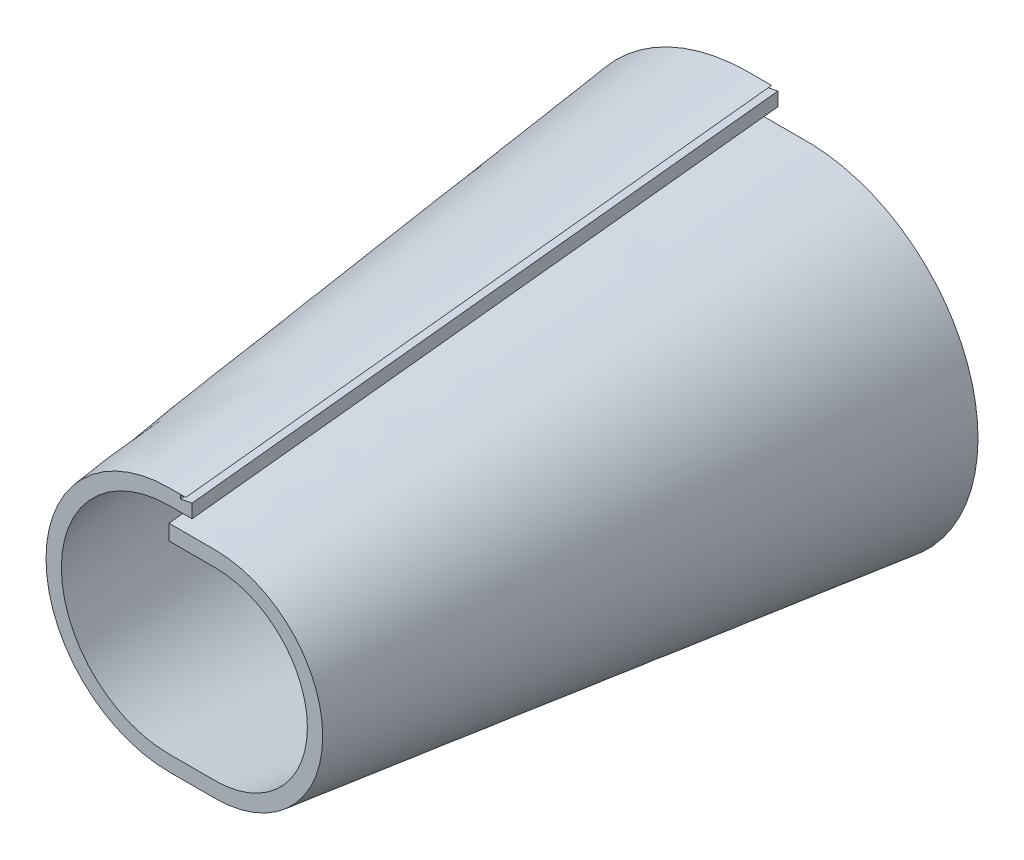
ISO-10303-21;
HEADER;
FILE_DESCRIPTION(('STEP AP214'),'2;1');
FILE_NAME('part.step','',(''),(''),'','','');
FILE_SCHEMA(('AUTOMOTIVE_DESIGN { 1 0 10303 214 1 1 1 1 }'));
ENDSEC;
DATA;
#1=APPLICATION_CONTEXT('core data for automotive mechanical design processes');
#2=APPLICATION_PROTOCOL_DEFINITION('international standard','automotive_design',2000,#1);
#3=PRODUCT_CONTEXT('',#1,'mechanical');
#4=PRODUCT('Part','Part','',(#3));
#5=PRODUCT_RELATED_PRODUCT_CATEGORY('part','',(#4));
#6=PRODUCT_DEFINITION_FORMATION('','',#4);
#7=PRODUCT_DEFINITION_CONTEXT('part definition',#1,'design');
#8=PRODUCT_DEFINITION('design','',#6,#7);
#9=PRODUCT_DEFINITION_SHAPE('','',#8);
#10=(LENGTH_UNIT() NAMED_UNIT(*) SI_UNIT(.MILLI.,.METRE.));
#11=(NAMED_UNIT(*) PLANE_ANGLE_UNIT() SI_UNIT($,.RADIAN.));
#12=(NAMED_UNIT(*) SI_UNIT($,.STERADIAN.) SOLID_ANGLE_UNIT());
#13=UNCERTAINTY_MEASURE_WITH_UNIT(LENGTH_MEASURE(1.E-05),#10,'distance_accuracy_value','');
#14=(GEOMETRIC_REPRESENTATION_CONTEXT(3) GLOBAL_UNCERTAINTY_ASSIGNED_CONTEXT((#13)) GLOBAL_UNIT_ASSIGNED_CONTEXT((#10,
#11,#12)) REPRESENTATION_CONTEXT('',''));
#15=CARTESIAN_POINT('',(0.,0.,0.));
#16=DIRECTION('',(0.,0.,1.));
#17=DIRECTION('',(1.,0.,0.));
#18=AXIS2_PLACEMENT_3D('',#15,#16,#17);
#19=CARTESIAN_POINT('',(6.,0.,0.));
#20=DIRECTION('',(0.,0.,-1.));
#21=DIRECTION('',(-1.,0.,0.));
#22=AXIS2_PLACEMENT_3D('',#19,#20,#21);
#23=PLANE('',#22);
#24=DIRECTION('',(-0.981797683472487,-0.189929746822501,0.));
#25=VECTOR('',#24,1.);
#26=CARTESIAN_POINT('',(0.,35.5429484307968,0.));
#27=LINE('',#26,#25);
#28=CARTESIAN_POINT('',(0.,35.5429484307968,0.));
#29=VERTEX_POINT('',#28);
#30=CARTESIAN_POINT('',(-2.9890094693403,34.9647215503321,0.));
#31=VERTEX_POINT('',#30);
#32=EDGE_CURVE('E350',#29,#31,#27,.T.);
#33=ORIENTED_EDGE('',*,*,#32,.T.);
#34=DIRECTION('',(0.,-1.,0.));
#35=VECTOR('',#34,1.);
#36=CARTESIAN_POINT('',(-2.9890094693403,35.9294431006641,0.));
#37=LINE('',#36,#35);
#38=CARTESIAN_POINT('',(-2.9890094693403,35.9294431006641,0.));
#39=VERTEX_POINT('',#38);
#40=EDGE_CURVE('E361',#39,#31,#37,.T.);
#41=ORIENTED_EDGE('',*,*,#40,.F.);
#42=DIRECTION('',(-0.998642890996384,-0.0520804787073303,0.));
#43=VECTOR('',#42,1.);
#44=CARTESIAN_POINT('',(0.0109905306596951,36.0858968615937,0.));
#45=LINE('',#44,#43);
#46=CARTESIAN_POINT('',(-1.6360813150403,36.,0.));
#47=VERTEX_POINT('',#46);
#48=EDGE_CURVE('E779',#47,#39,#45,.T.);
#49=ORIENTED_EDGE('',*,*,#48,.F.);
#50=DIRECTION('',(-1.,0.,0.));
#51=VECTOR('',#50,1.);
#52=CARTESIAN_POINT('',(-6.,36.,0.));
#53=LINE('',#52,#51);
#54=CARTESIAN_POINT('',(-5.9999999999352,36.,0.));
#55=VERTEX_POINT('',#54);
#56=EDGE_CURVE('E379',#47,#55,#53,.T.);
#57=ORIENTED_EDGE('',*,*,#56,.T.);
#58=CARTESIAN_POINT('',(-6.,4.,0.));
#59=DIRECTION('',(0.,0.,1.));
#60=DIRECTION('',(-1.,0.,0.));
#61=AXIS2_PLACEMENT_3D('',#58,#59,#60);
#62=CIRCLE('',#61,32.);
#63=CARTESIAN_POINT('',(-6.00000000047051,-28.,0.));
#64=VERTEX_POINT('',#63);
#65=EDGE_CURVE('E492',#55,#64,#62,.T.);
#66=ORIENTED_EDGE('',*,*,#65,.T.);
#67=DIRECTION('',(1.,0.,0.));
#68=VECTOR('',#67,1.);
#69=CARTESIAN_POINT('',(-6.,-28.,0.));
#70=LINE('',#69,#68);
#71=CARTESIAN_POINT('',(6.,-28.,0.));
#72=VERTEX_POINT('',#71);
#73=EDGE_CURVE('E497',#64,#72,#70,.T.);
#74=ORIENTED_EDGE('',*,*,#73,.T.);
#75=CARTESIAN_POINT('',(6.,0.,0.));
#76=DIRECTION('',(0.,0.,1.));
#77=DIRECTION('',(-1.,0.,0.));
#78=AXIS2_PLACEMENT_3D('',#75,#76,#77);
#79=CIRCLE('',#78,28.);
#80=CARTESIAN_POINT('',(6.,28.,0.));
#81=VERTEX_POINT('',#80);
#82=EDGE_CURVE('E501',#72,#81,#79,.T.);
#83=ORIENTED_EDGE('',*,*,#82,.T.);
#84=DIRECTION('',(-1.,0.,0.));
#85=VECTOR('',#84,1.);
#86=CARTESIAN_POINT('',(-6.,28.,0.));
#87=LINE('',#86,#85);
#88=CARTESIAN_POINT('',(-6.,28.,0.));
#89=VERTEX_POINT('',#88);
#90=EDGE_CURVE('E290',#81,#89,#87,.T.);
#91=ORIENTED_EDGE('',*,*,#90,.T.);
#92=DIRECTION('',(0.,-1.,0.));
#93=VECTOR('',#92,1.);
#94=CARTESIAN_POINT('',(-6.,28.,0.));
#95=LINE('',#94,#93);
#96=CARTESIAN_POINT('',(-6.,24.,0.));
#97=VERTEX_POINT('',#96);
#98=EDGE_CURVE('E435',#89,#97,#95,.T.);
#99=ORIENTED_EDGE('',*,*,#98,.T.);
#100=DIRECTION('',(1.,0.,0.));
#101=VECTOR('',#100,1.);
#102=CARTESIAN_POINT('',(-6.,24.,0.));
#103=LINE('',#102,#101);
#104=CARTESIAN_POINT('',(5.99999999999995,24.,0.));
#105=VERTEX_POINT('',#104);
#106=EDGE_CURVE('E425',#97,#105,#103,.T.);
#107=ORIENTED_EDGE('',*,*,#106,.T.);
#108=CARTESIAN_POINT('',(6.,0.,0.));
#109=DIRECTION('',(0.,0.,-1.));
#110=DIRECTION('',(-1.,0.,0.));
#111=AXIS2_PLACEMENT_3D('',#108,#109,#110);
#112=CIRCLE('',#111,24.);
#113=CARTESIAN_POINT('',(6.00000000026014,-24.,0.));
#114=VERTEX_POINT('',#113);
#115=EDGE_CURVE('E415',#105,#114,#112,.T.);
#116=ORIENTED_EDGE('',*,*,#115,.T.);
#117=DIRECTION('',(-1.,0.,0.));
#118=VECTOR('',#117,1.);
#119=CARTESIAN_POINT('',(6.,-24.,0.));
#120=LINE('',#119,#118);
#121=CARTESIAN_POINT('',(-6.00000000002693,-24.,0.));
#122=VERTEX_POINT('',#121);
#123=EDGE_CURVE('E405',#114,#122,#120,.T.);
#124=ORIENTED_EDGE('',*,*,#123,.T.);
#125=CARTESIAN_POINT('',(-5.99999999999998,4.,0.));
#126=DIRECTION('',(0.,0.,-1.));
#127=DIRECTION('',(-1.,0.,0.));
#128=AXIS2_PLACEMENT_3D('',#125,#126,#127);
#129=CIRCLE('',#128,28.);
#130=CARTESIAN_POINT('',(-6.00000000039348,32.,0.));
#131=VERTEX_POINT('',#130);
#132=EDGE_CURVE('E396',#122,#131,#129,.T.);
#133=ORIENTED_EDGE('',*,*,#132,.T.);
#134=DIRECTION('',(1.,0.,0.));
#135=VECTOR('',#134,1.);
#136=CARTESIAN_POINT('',(0.,32.,0.));
#137=LINE('',#136,#135);
#138=CARTESIAN_POINT('',(0.,32.,0.));
#139=VERTEX_POINT('',#138);
#140=EDGE_CURVE('E376',#131,#139,#137,.T.);
#141=ORIENTED_EDGE('',*,*,#140,.T.);
#142=DIRECTION('',(0.,1.,0.));
#143=VECTOR('',#142,1.);
#144=CARTESIAN_POINT('',(0.,36.,0.));
#145=LINE('',#144,#143);
#146=EDGE_CURVE('E267',#139,#29,#145,.T.);
#147=ORIENTED_EDGE('',*,*,#146,.T.);
#148=EDGE_LOOP('',(#33,#41,#49,#57,#66,#74,#83,#91,#99,#107,#116,#124,#133,#141,#147));
#149=FACE_BOUND('',#148,.T.);
#150=ADVANCED_FACE('F263',(#149),#23,.F.);
#151=CARTESIAN_POINT('',(0.,54.1738488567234,-203.2));
#152=DIRECTION('',(1.,0.,0.));
#153=DIRECTION('',(0.,1.,0.));
#154=AXIS2_PLACEMENT_3D('',#151,#152,#153);
#155=PLANE('',#154);
#156=DIRECTION('',(0.,-1.,0.));
#157=VECTOR('',#156,1.);
#158=CARTESIAN_POINT('',(0.,54.1738488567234,-152.4));
#159=LINE('',#158,#157);
#160=CARTESIAN_POINT('',(0.,52.1733350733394,-152.4));
#161=VERTEX_POINT('',#160);
#162=CARTESIAN_POINT('',(0.,48.6303866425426,-152.4));
#163=VERTEX_POINT('',#162);
#164=EDGE_CURVE('E370',#161,#163,#159,.T.);
#165=ORIENTED_EDGE('',*,*,#164,.F.);
#166=DIRECTION('',(0.,-0.10847930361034,0.994098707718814));
#167=VECTOR('',#166,1.);
#168=CARTESIAN_POINT('',(0.,57.5859429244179,-202.000857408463));
#169=LINE('',#168,#167);
#170=EDGE_CURVE('E353',#161,#29,#169,.T.);
#171=ORIENTED_EDGE('',*,*,#170,.T.);
#172=ORIENTED_EDGE('',*,*,#146,.F.);
#173=DIRECTION('',(0.,-0.10847930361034,0.994098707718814));
#174=VECTOR('',#173,1.);
#175=CARTESIAN_POINT('',(0.,43.0869244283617,-101.6));
#176=LINE('',#175,#174);
#177=EDGE_CURVE('E442',#163,#139,#176,.T.);
#178=ORIENTED_EDGE('',*,*,#177,.F.);
#179=EDGE_LOOP('',(#165,#171,#172,#178));
#180=FACE_BOUND('',#179,.T.);
#181=ADVANCED_FACE('F366',(#180),#155,.T.);
#182=CARTESIAN_POINT('',(0.,0.,-152.4));
#183=DIRECTION('',(0.,0.,1.));
#184=DIRECTION('',(1.,0.,0.));
#185=AXIS2_PLACEMENT_3D('',#182,#183,#184);
#186=PLANE('',#185);
#187=DIRECTION('',(-0.981797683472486,-0.189929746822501,0.));
#188=VECTOR('',#187,1.);
#189=CARTESIAN_POINT('',(-9.72889668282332,50.2912702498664,-152.4));
#190=LINE('',#189,#188);
#191=CARTESIAN_POINT('',(-2.98900946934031,51.5951081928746,-152.4));
#192=VERTEX_POINT('',#191);
#193=EDGE_CURVE('E12',#161,#192,#190,.T.);
#194=ORIENTED_EDGE('',*,*,#193,.F.);
#195=ORIENTED_EDGE('',*,*,#164,.T.);
#196=CARTESIAN_POINT('',(0.,48.6303866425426,-152.4));
#197=CARTESIAN_POINT('',(-0.478389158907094,48.6303866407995,-152.4));
#198=CARTESIAN_POINT('',(-0.956778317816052,48.6303866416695,-152.4));
#199=CARTESIAN_POINT('',(-1.91526284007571,48.6303866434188,-152.4));
#200=CARTESIAN_POINT('',(-2.39535820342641,48.6303866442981,-152.4));
#201=CARTESIAN_POINT('',(-3.11612503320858,48.6303866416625,-152.4));
#202=CARTESIAN_POINT('',(-3.35679649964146,48.6303866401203,-152.4));
#203=CARTESIAN_POINT('',(-3.83813985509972,48.6303866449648,-152.4));
#204=CARTESIAN_POINT('',(-4.07881174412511,48.6303866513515,-152.4));
#205=CARTESIAN_POINT('',(-4.56055097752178,48.6303866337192,-152.4));
#206=CARTESIAN_POINT('',(-4.80161832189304,48.6303866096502,-152.4));
#207=CARTESIAN_POINT('',(-5.28375145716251,48.6303866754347,-152.4));
#208=CARTESIAN_POINT('',(-5.52481724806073,48.6303867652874,-152.4));
#209=CARTESIAN_POINT('',(-6.00711249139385,48.6303865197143,-152.4));
#210=CARTESIAN_POINT('',(-6.24834194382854,48.6303861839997,-152.4));
#211=CARTESIAN_POINT('',(-6.61018871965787,48.6303868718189,-152.4));
#212=CARTESIAN_POINT('',(-6.73080604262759,48.6303872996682,-152.4));
#213=CARTESIAN_POINT('',(-6.9117323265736,48.6303863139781,-152.4));
#214=CARTESIAN_POINT('',(-6.97204128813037,48.6303857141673,-152.4));
#215=CARTESIAN_POINT('',(-7.09265921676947,48.6303875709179,-152.4));
#216=CARTESIAN_POINT('',(-7.15296818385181,48.6303900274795,-152.4));
#217=CARTESIAN_POINT('',(-7.27357526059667,48.6303832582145,-152.4));
#218=CARTESIAN_POINT('',(-7.33387337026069,48.6303740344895,-152.4));
#219=CARTESIAN_POINT('',(-7.45446961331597,48.6303992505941,-152.4));
#220=CARTESIAN_POINT('',(-7.51476774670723,48.6304336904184,-152.4));
#221=CARTESIAN_POINT('',(-7.63536329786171,48.6302823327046,-152.4));
#222=CARTESIAN_POINT('',(-7.69566071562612,48.6300965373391,-152.4));
#223=CARTESIAN_POINT('',(-7.81625416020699,48.6294732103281,-152.4));
#224=CARTESIAN_POINT('',(-7.87655018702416,48.6290356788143,-152.4));
#225=CARTESIAN_POINT('',(-8.05742899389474,48.6273573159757,-152.4));
#226=CARTESIAN_POINT('',(-8.1780086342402,48.6257507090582,-152.4));
#227=CARTESIAN_POINT('',(-8.41915183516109,48.6215567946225,-152.4));
#228=CARTESIAN_POINT('',(-8.53971539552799,48.6189694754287,-152.4));
#229=CARTESIAN_POINT('',(-8.90323949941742,48.6096920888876,-152.4));
#230=CARTESIAN_POINT('',(-9.1461636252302,48.6015038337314,-152.4));
#231=CARTESIAN_POINT('',(-9.63185708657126,48.5811572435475,-152.4));
#232=CARTESIAN_POINT('',(-9.87462641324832,48.5689986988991,-152.4));
#233=CARTESIAN_POINT('',(-10.3595577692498,48.5407401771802,-152.4));
#234=CARTESIAN_POINT('',(-10.6017201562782,48.5246463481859,-152.4));
#235=CARTESIAN_POINT('',(-11.0857444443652,48.488514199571,-152.4));
#236=CARTESIAN_POINT('',(-11.3276063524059,48.4684759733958,-152.4));
#237=CARTESIAN_POINT('',(-11.8107031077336,48.4244853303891,-152.4));
#238=CARTESIAN_POINT('',(-12.0519383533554,48.4005372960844,-152.4));
#239=CARTESIAN_POINT('',(-12.5339867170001,48.3487176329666,-152.4));
#240=CARTESIAN_POINT('',(-12.7747998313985,48.3208459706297,-152.4));
#241=CARTESIAN_POINT('',(-13.4961634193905,48.2313968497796,-152.4));
#242=CARTESIAN_POINT('',(-13.9760000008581,48.1639523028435,-152.4));
#243=CARTESIAN_POINT('',(-14.9330692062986,48.0134877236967,-152.4));
#244=CARTESIAN_POINT('',(-15.4103025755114,47.9304724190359,-152.4));
#245=CARTESIAN_POINT('',(-16.3618470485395,47.7488834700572,-152.4));
#246=CARTESIAN_POINT('',(-16.8361578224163,47.6503081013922,-152.4));
#247=CARTESIAN_POINT('',(-18.0316440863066,47.3814367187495,-152.4));
#248=CARTESIAN_POINT('',(-18.7505214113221,47.2008061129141,-152.4));
#249=CARTESIAN_POINT('',(-20.1792612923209,46.803770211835,-152.4));
#250=CARTESIAN_POINT('',(-20.8891115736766,46.5873208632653,-152.4));
#251=CARTESIAN_POINT('',(-22.2976303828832,46.1191838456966,-152.4));
#252=CARTESIAN_POINT('',(-22.9962911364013,45.8674727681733,-152.4));
#253=CARTESIAN_POINT('',(-24.3802276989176,45.3293887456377,-152.4));
#254=CARTESIAN_POINT('',(-25.0655019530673,45.0430118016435,-152.4));
#255=CARTESIAN_POINT('',(-26.4184240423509,44.4374650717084,-152.4));
#256=CARTESIAN_POINT('',(-27.0861267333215,44.118417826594,-152.4));
#257=CARTESIAN_POINT('',(-28.4045396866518,43.4477348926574,-152.4));
#258=CARTESIAN_POINT('',(-29.0552582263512,43.0961154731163,-152.4));
#259=CARTESIAN_POINT('',(-30.3382270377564,42.3611317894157,-152.4));
#260=CARTESIAN_POINT('',(-30.9704834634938,41.977778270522,-152.4));
#261=CARTESIAN_POINT('',(-32.2150006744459,41.1801241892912,-152.4));
#262=CARTESIAN_POINT('',(-32.8272648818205,40.7658289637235,-152.4));
#263=CARTESIAN_POINT('',(-34.1089536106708,39.8512631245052,-152.4));
#264=CARTESIAN_POINT('',(-34.7754119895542,39.346827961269,-152.4));
#265=CARTESIAN_POINT('',(-36.0790240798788,38.3013812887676,-152.4));
#266=CARTESIAN_POINT('',(-36.7161765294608,37.7603682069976,-152.4));
#267=CARTESIAN_POINT('',(-37.9591192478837,36.6434192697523,-152.4));
#268=CARTESIAN_POINT('',(-38.5649093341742,36.0674832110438,-152.4));
#269=CARTESIAN_POINT('',(-39.7436282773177,34.8818421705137,-152.4));
#270=CARTESIAN_POINT('',(-40.3165253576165,34.2721056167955,-152.4));
#271=CARTESIAN_POINT('',(-41.4271979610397,33.0213966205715,-152.4));
#272=CARTESIAN_POINT('',(-41.9649739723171,32.3804246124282,-152.4));
#273=CARTESIAN_POINT('',(-42.7439311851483,31.3972043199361,-152.4));
#274=CARTESIAN_POINT('',(-42.9989631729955,31.0658408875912,-152.4));
#275=CARTESIAN_POINT('',(-43.4996755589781,30.3960013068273,-152.4));
#276=CARTESIAN_POINT('',(-43.7453538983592,30.0575236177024,-152.4));
#277=CARTESIAN_POINT('',(-44.3474686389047,29.202893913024,-152.4));
#278=CARTESIAN_POINT('',(-44.697893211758,28.6824899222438,-152.4));
#279=CARTESIAN_POINT('',(-45.3764644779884,27.6272787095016,-152.4));
#280=CARTESIAN_POINT('',(-45.7046083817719,27.0924696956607,-152.4));
#281=CARTESIAN_POINT('',(-46.3381037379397,26.0094503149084,-152.4));
#282=CARTESIAN_POINT('',(-46.6434531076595,25.4612387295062,-152.4));
#283=CARTESIAN_POINT('',(-47.2307831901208,24.3524621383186,-152.4));
#284=CARTESIAN_POINT('',(-47.5127646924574,23.7918975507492,-152.4));
#285=CARTESIAN_POINT('',(-48.0527165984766,22.6596629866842,-152.4));
#286=CARTESIAN_POINT('',(-48.3106989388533,22.0879987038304,-152.4));
#287=CARTESIAN_POINT('',(-48.8022605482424,20.9342696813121,-152.4));
#288=CARTESIAN_POINT('',(-49.0358396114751,20.3522048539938,-152.4));
#289=CARTESIAN_POINT('',(-49.4782259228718,19.1787308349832,-152.4));
#290=CARTESIAN_POINT('',(-49.687033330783,18.5873217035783,-152.4));
#291=CARTESIAN_POINT('',(-50.0795571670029,17.3962800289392,-152.4));
#292=CARTESIAN_POINT('',(-50.2632737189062,16.7966475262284,-152.4));
#293=CARTESIAN_POINT('',(-50.7761606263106,14.987447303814,-152.4));
#294=CARTESIAN_POINT('',(-51.0673326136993,13.766875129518,-152.4));
#295=CARTESIAN_POINT('',(-51.5455236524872,11.3054957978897,-152.4));
#296=CARTESIAN_POINT('',(-51.7325426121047,10.0646886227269,-152.4));
#297=CARTESIAN_POINT('',(-51.9343896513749,8.19511848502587,-152.4));
#298=CARTESIAN_POINT('',(-51.9885621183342,7.57037844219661,-152.4));
#299=CARTESIAN_POINT('',(-52.0705619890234,6.31913498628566,-152.4));
#300=CARTESIAN_POINT('',(-52.0983895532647,5.69263158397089,-152.4));
#301=CARTESIAN_POINT('',(-52.1275640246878,4.43901640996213,-152.4));
#302=CARTESIAN_POINT('',(-52.1289108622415,3.81190463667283,-152.4));
#303=CARTESIAN_POINT('',(-52.1051007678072,2.55818053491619,-152.4));
#304=CARTESIAN_POINT('',(-52.0799437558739,1.93156820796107,-152.4));
#305=CARTESIAN_POINT('',(-52.0032689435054,0.68000594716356,-152.4));
#306=CARTESIAN_POINT('',(-51.9517530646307,0.05505589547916,-152.4));
#307=CARTESIAN_POINT('',(-51.8224666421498,-1.19212287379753,-152.4));
#308=CARTESIAN_POINT('',(-51.7446960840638,-1.81435158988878,-152.4));
#309=CARTESIAN_POINT('',(-51.5630173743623,-3.05498643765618,-152.4));
#310=CARTESIAN_POINT('',(-51.4591091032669,-3.67339255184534,-152.4));
#311=CARTESIAN_POINT('',(-51.2252437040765,-4.90525204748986,-152.4));
#312=CARTESIAN_POINT('',(-51.0952867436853,-5.51870546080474,-152.4));
#313=CARTESIAN_POINT('',(-50.8096722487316,-6.73926988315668,-152.4));
#314=CARTESIAN_POINT('',(-50.6540284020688,-7.34638408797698,-152.4));
#315=CARTESIAN_POINT('',(-50.317356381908,-8.55348864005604,-152.4));
#316=CARTESIAN_POINT('',(-50.136327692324,-9.15347884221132,-152.4));
#317=CARTESIAN_POINT('',(-49.5555981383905,-10.9412358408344,-152.4));
#318=CARTESIAN_POINT('',(-49.1181867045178,-12.1170754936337,-152.4));
#319=CARTESIAN_POINT('',(-48.3079230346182,-14.0421287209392,-152.4));
#320=CARTESIAN_POINT('',(-47.9621360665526,-14.8029277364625,-152.4));
#321=CARTESIAN_POINT('',(-47.2283960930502,-16.3040018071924,-152.4));
#322=CARTESIAN_POINT('',(-46.8404427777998,-17.0442767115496,-152.4));
#323=CARTESIAN_POINT('',(-46.0236614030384,-18.5019027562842,-152.4));
#324=CARTESIAN_POINT('',(-45.5948332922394,-19.2192538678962,-152.4));
#325=CARTESIAN_POINT('',(-44.6968099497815,-20.6297759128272,-152.4));
#326=CARTESIAN_POINT('',(-44.2275541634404,-21.3229083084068,-152.4));
#327=CARTESIAN_POINT('',(-43.2507504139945,-22.6816366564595,-152.4));
#328=CARTESIAN_POINT('',(-42.7432025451,-23.3472326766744,-152.4));
#329=CARTESIAN_POINT('',(-41.6915627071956,-24.648870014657,-152.4));
#330=CARTESIAN_POINT('',(-41.1474716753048,-25.2849120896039,-152.4));
#331=CARTESIAN_POINT('',(-40.0237044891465,-26.5261815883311,-152.4));
#332=CARTESIAN_POINT('',(-39.4439851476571,-27.1313699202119,-152.4));
#333=CARTESIAN_POINT('',(-38.2512750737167,-28.3080465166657,-152.4));
#334=CARTESIAN_POINT('',(-37.6382836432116,-28.8795340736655,-152.4));
#335=CARTESIAN_POINT('',(-36.3810788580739,-29.9871612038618,-152.4));
#336=CARTESIAN_POINT('',(-35.7368631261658,-30.523298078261,-152.4));
#337=CARTESIAN_POINT('',(-34.4218112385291,-31.5565532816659,-152.4));
#338=CARTESIAN_POINT('',(-33.7510853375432,-32.0538119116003,-152.4));
#339=CARTESIAN_POINT('',(-32.3828026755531,-33.0098008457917,-152.4));
#340=CARTESIAN_POINT('',(-31.6852479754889,-33.4685341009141,-152.4));
#341=CARTESIAN_POINT('',(-30.26563070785,-34.3459901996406,-152.4));
#342=CARTESIAN_POINT('',(-29.5435748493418,-34.7647238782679,-152.4));
#343=CARTESIAN_POINT('',(-28.3713665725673,-35.4013455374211,-152.4));
#344=CARTESIAN_POINT('',(-27.9283223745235,-35.6324248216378,-152.4));
#345=CARTESIAN_POINT('',(-27.0347206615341,-36.0795932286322,-152.4));
#346=CARTESIAN_POINT('',(-26.5841632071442,-36.2956824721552,-152.4));
#347=CARTESIAN_POINT('',(-25.6759499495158,-36.712647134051,-152.4));
#348=CARTESIAN_POINT('',(-25.2182926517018,-36.9135192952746,-152.4));
#349=CARTESIAN_POINT('',(-24.2962626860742,-37.2998096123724,-152.4));
#350=CARTESIAN_POINT('',(-23.8318871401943,-37.4852209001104,-152.4));
#351=CARTESIAN_POINT('',(-22.8968447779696,-37.8404271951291,-152.4));
#352=CARTESIAN_POINT('',(-22.4261739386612,-38.0102116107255,-152.4));
#353=CARTESIAN_POINT('',(-21.4761553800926,-38.334972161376,-152.4));
#354=CARTESIAN_POINT('',(-20.9967703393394,-38.4898391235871,-152.4));
#355=CARTESIAN_POINT('',(-20.0330137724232,-38.7832797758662,-152.4));
#356=CARTESIAN_POINT('',(-19.5486420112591,-38.9218526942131,-152.4));
#357=CARTESIAN_POINT('',(-18.5758001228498,-39.182446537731,-152.4));
#358=CARTESIAN_POINT('',(-18.0873328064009,-39.3044779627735,-152.4));
#359=CARTESIAN_POINT('',(-17.1071824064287,-39.531776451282,-152.4));
#360=CARTESIAN_POINT('',(-16.6155044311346,-39.6370654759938,-152.4));
#361=CARTESIAN_POINT('',(-15.8760390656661,-39.7823419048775,-152.4));
#362=CARTESIAN_POINT('',(-15.6294717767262,-39.8286181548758,-152.4));
#363=CARTESIAN_POINT('',(-15.1355885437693,-39.9169963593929,-152.4));
#364=CARTESIAN_POINT('',(-14.888272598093,-39.9590983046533,-152.4));
#365=CARTESIAN_POINT('',(-14.2302347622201,-40.0654113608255,-152.4));
#366=CARTESIAN_POINT('',(-13.8189184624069,-40.1259729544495,-152.4));
#367=CARTESIAN_POINT('',(-12.9947142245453,-40.2355884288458,-152.4));
#368=CARTESIAN_POINT('',(-12.5818261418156,-40.2846412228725,-152.4));
#369=CARTESIAN_POINT('',(-11.961647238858,-40.3495554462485,-152.4));
#370=CARTESIAN_POINT('',(-11.7548014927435,-40.3697476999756,-152.4));
#371=CARTESIAN_POINT('',(-11.3408481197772,-40.407243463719,-152.4));
#372=CARTESIAN_POINT('',(-11.1337404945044,-40.4245469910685,-152.4));
#373=CARTESIAN_POINT('',(-10.7193371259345,-40.4562589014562,-152.4));
#374=CARTESIAN_POINT('',(-10.5120414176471,-40.4706677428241,-152.4));
#375=CARTESIAN_POINT('',(-10.0972652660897,-40.4965900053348,-152.4));
#376=CARTESIAN_POINT('',(-9.88978481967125,-40.5081033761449,-152.4));
#377=CARTESIAN_POINT('',(-9.47418939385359,-40.5282548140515,-152.4));
#378=CARTESIAN_POINT('',(-9.26607407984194,-40.5368859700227,-152.4));
#379=CARTESIAN_POINT('',(-8.84975032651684,-40.551229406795,-152.4));
#380=CARTESIAN_POINT('',(-8.64154189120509,-40.5569418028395,-152.4));
#381=CARTESIAN_POINT('',(-8.32917061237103,-40.5633232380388,-152.4));
#382=CARTESIAN_POINT('',(-8.22502900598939,-40.565085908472,-152.4));
#383=CARTESIAN_POINT('',(-8.01673641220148,-40.5678740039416,-152.4));
#384=CARTESIAN_POINT('',(-7.91258542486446,-40.5688994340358,-152.4));
#385=CARTESIAN_POINT('',(-7.75635387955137,-40.5699067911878,-152.4));
#386=CARTESIAN_POINT('',(-7.70427491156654,-40.5701541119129,-152.4));
#387=CARTESIAN_POINT('',(-7.60011632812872,-40.5704332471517,-152.4));
#388=CARTESIAN_POINT('',(-7.5480367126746,-40.5704650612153,-152.4));
#389=CARTESIAN_POINT('',(-7.44387729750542,-40.5704884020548,-152.4));
#390=CARTESIAN_POINT('',(-7.39179749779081,-40.5704799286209,-152.4));
#391=CARTESIAN_POINT('',(-7.28763792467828,-40.5704735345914,-152.4));
#392=CARTESIAN_POINT('',(-7.23555815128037,-40.5704756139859,-152.4));
#393=CARTESIAN_POINT('',(-7.07901675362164,-40.5704789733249,-152.4));
#394=CARTESIAN_POINT('',(-6.97455513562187,-40.5704773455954,-152.4));
#395=CARTESIAN_POINT('',(-6.76563218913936,-40.5704761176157,-152.4));
#396=CARTESIAN_POINT('',(-6.66117086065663,-40.5704765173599,-152.4));
#397=CARTESIAN_POINT('',(-6.34779032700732,-40.5704771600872,-152.4));
#398=CARTESIAN_POINT('',(-6.13887112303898,-40.5704768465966,-152.4));
#399=CARTESIAN_POINT('',(-5.72104552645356,-40.5704766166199,-152.4));
#400=CARTESIAN_POINT('',(-5.51213913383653,-40.5704767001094,-152.4));
#401=CARTESIAN_POINT('',(-5.09432534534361,-40.5704767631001,-152.4));
#402=CARTESIAN_POINT('',(-4.88541794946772,-40.5704767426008,-152.4));
#403=CARTESIAN_POINT('',(-4.25784494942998,-40.5704767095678,-152.4));
#404=CARTESIAN_POINT('',(-3.8391793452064,-40.5704767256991,-152.4));
#405=CARTESIAN_POINT('',(-3.00184055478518,-40.5704767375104,-152.4));
#406=CARTESIAN_POINT('',(-2.58316736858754,-40.57047673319,-152.4));
#407=CARTESIAN_POINT('',(-1.74517740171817,-40.5704767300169,-152.4));
#408=CARTESIAN_POINT('',(-1.32586062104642,-40.5704767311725,-152.4));
#409=CARTESIAN_POINT('',(-0.487228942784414,-40.5704767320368,-152.4));
#410=CARTESIAN_POINT('',(-0.0679140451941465,-40.5704767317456,-152.4));
#411=CARTESIAN_POINT('',(0.769846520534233,-40.5704767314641,-152.4));
#412=CARTESIAN_POINT('',(1.18829218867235,-40.5704767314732,-152.4));
#413=CARTESIAN_POINT('',(2.02518346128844,-40.5704767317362,-152.4));
#414=CARTESIAN_POINT('',(2.44362906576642,-40.5704767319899,-152.4));
#415=CARTESIAN_POINT('',(3.07110553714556,-40.5704767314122,-152.4));
#416=CARTESIAN_POINT('',(3.28013640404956,-40.5704767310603,-152.4));
#417=CARTESIAN_POINT('',(3.69819825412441,-40.570476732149,-152.4));
#418=CARTESIAN_POINT('',(3.90722923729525,-40.5704767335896,-152.4));
#419=CARTESIAN_POINT('',(4.32529242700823,-40.5704767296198,-152.4));
#420=CARTESIAN_POINT('',(4.53432463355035,-40.5704767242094,-152.4));
#421=CARTESIAN_POINT('',(4.95238861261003,-40.570476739,-152.4));
#422=CARTESIAN_POINT('',(5.16142038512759,-40.570476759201,-152.4));
#423=CARTESIAN_POINT('',(5.57908409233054,-40.5704767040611,-152.4));
#424=CARTESIAN_POINT('',(5.78771602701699,-40.5704766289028,-152.4));
#425=CARTESIAN_POINT('',(6.20498151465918,-40.5704768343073,-152.4));
#426=CARTESIAN_POINT('',(6.41361506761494,-40.5704771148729,-152.4));
#427=CARTESIAN_POINT('',(6.72656476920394,-40.5704765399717,-152.4));
#428=CARTESIAN_POINT('',(6.83088092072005,-40.5704761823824,-152.4));
#429=CARTESIAN_POINT('',(7.03951328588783,-40.5704772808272,-152.4));
#430=CARTESIAN_POINT('',(7.14382949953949,-40.5704787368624,-152.4));
#431=CARTESIAN_POINT('',(7.30030321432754,-40.5704757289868,-152.4));
#432=CARTESIAN_POINT('',(7.35246073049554,-40.5704738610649,-152.4));
#433=CARTESIAN_POINT('',(7.45677575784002,-40.5704796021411,-152.4));
#434=CARTESIAN_POINT('',(7.50893326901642,-40.5704872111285,-152.4));
#435=CARTESIAN_POINT('',(7.66540422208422,-40.570183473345,-152.4));
#436=CARTESIAN_POINT('',(7.7697172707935,-40.5695455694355,-152.4));
#437=CARTESIAN_POINT('',(7.97793218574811,-40.5674847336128,-152.4));
#438=CARTESIAN_POINT('',(8.0818340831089,-40.566064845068,-152.4));
#439=CARTESIAN_POINT('',(8.28962485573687,-40.5624212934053,-152.4));
#440=CARTESIAN_POINT('',(8.39351373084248,-40.5601976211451,-152.4));
#441=CARTESIAN_POINT('',(8.705152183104,-40.5523297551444,-152.4));
#442=CARTESIAN_POINT('',(8.91287276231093,-40.5454887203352,-152.4));
#443=CARTESIAN_POINT('',(9.328176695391,-40.5286163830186,-152.4));
#444=CARTESIAN_POINT('',(9.53576005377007,-40.5185851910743,-152.4));
#445=CARTESIAN_POINT('',(9.9507463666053,-40.4953388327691,-152.4));
#446=CARTESIAN_POINT('',(10.1581493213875,-40.4821236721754,-152.4));
#447=CARTESIAN_POINT('',(10.7789455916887,-40.4377854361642,-152.4));
#448=CARTESIAN_POINT('',(11.1920110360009,-40.40192546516,-152.4));
#449=CARTESIAN_POINT('',(12.0168698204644,-40.3175907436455,-152.4));
#450=CARTESIAN_POINT('',(12.4286630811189,-40.269115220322,-152.4));
#451=CARTESIAN_POINT('',(13.250661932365,-40.1595766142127,-152.4));
#452=CARTESIAN_POINT('',(13.660867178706,-40.0985109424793,-152.4));
#453=CARTESIAN_POINT('',(14.4791845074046,-39.9638423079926,-152.4));
#454=CARTESIAN_POINT('',(14.8872967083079,-39.8902400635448,-152.4));
#455=CARTESIAN_POINT('',(15.8539808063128,-39.7005229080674,-152.4));
#456=CARTESIAN_POINT('',(16.4114667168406,-39.5788256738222,-152.4));
#457=CARTESIAN_POINT('',(17.5222618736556,-39.3117103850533,-152.4));
#458=CARTESIAN_POINT('',(18.0755563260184,-39.1662309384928,-152.4));
#459=CARTESIAN_POINT('',(19.1762828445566,-38.8518441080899,-152.4));
#460=CARTESIAN_POINT('',(19.7237057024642,-38.682904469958,-152.4));
#461=CARTESIAN_POINT('',(20.8110173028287,-38.3220090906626,-152.4));
#462=CARTESIAN_POINT('',(21.3509047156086,-38.1300493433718,-152.4));
#463=CARTESIAN_POINT('',(22.4193714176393,-37.7244212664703,-152.4));
#464=CARTESIAN_POINT('',(22.947993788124,-37.5108664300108,-152.4));
#465=CARTESIAN_POINT('',(23.9952663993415,-37.0618212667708,-152.4));
#466=CARTESIAN_POINT('',(24.5139252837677,-36.8263510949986,-152.4));
#467=CARTESIAN_POINT('',(25.5406427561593,-36.3339381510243,-152.4));
#468=CARTESIAN_POINT('',(26.0487063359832,-36.0770057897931,-152.4));
#469=CARTESIAN_POINT('',(27.0535586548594,-35.5420735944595,-152.4));
#470=CARTESIAN_POINT('',(27.5503481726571,-35.2640752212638,-152.4));
#471=CARTESIAN_POINT('',(28.696042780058,-34.5909818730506,-152.4));
#472=CARTESIAN_POINT('',(29.3402352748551,-34.1878269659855,-152.4));
#473=CARTESIAN_POINT('',(30.6051361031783,-33.3458277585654,-152.4));
#474=CARTESIAN_POINT('',(31.2258366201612,-32.9069717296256,-152.4));
#475=CARTESIAN_POINT('',(32.4417365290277,-31.9951378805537,-152.4));
#476=CARTESIAN_POINT('',(33.0369337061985,-31.5221571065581,-152.4));
#477=CARTESIAN_POINT('',(34.2016340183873,-30.5421427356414,-152.4));
#478=CARTESIAN_POINT('',(34.7710552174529,-30.035011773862,-152.4));
#479=CARTESIAN_POINT('',(35.880316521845,-28.9894468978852,-152.4));
#480=CARTESIAN_POINT('',(36.4201595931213,-28.4510161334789,-152.4));
#481=CARTESIAN_POINT('',(37.4685528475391,-27.344631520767,-152.4));
#482=CARTESIAN_POINT('',(37.9771038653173,-26.7766784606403,-152.4));
#483=CARTESIAN_POINT('',(39.206829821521,-25.3230897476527,-152.4));
#484=CARTESIAN_POINT('',(39.9077579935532,-24.4201119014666,-152.4));
#485=CARTESIAN_POINT('',(40.8999831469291,-23.0240795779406,-152.4));
#486=CARTESIAN_POINT('',(41.2209016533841,-22.5517435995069,-152.4));
#487=CARTESIAN_POINT('',(41.8425298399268,-21.5939082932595,-152.4));
#488=CARTESIAN_POINT('',(42.1432398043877,-21.1084091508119,-152.4));
#489=CARTESIAN_POINT('',(42.7235909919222,-20.1257947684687,-152.4));
#490=CARTESIAN_POINT('',(43.0032575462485,-19.628694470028,-152.4));
#491=CARTESIAN_POINT('',(43.5414446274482,-18.6231697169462,-152.4));
#492=CARTESIAN_POINT('',(43.7999650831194,-18.1147452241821,-152.4));
#493=CARTESIAN_POINT('',(44.2953669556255,-17.0874692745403,-152.4));
#494=CARTESIAN_POINT('',(44.5322486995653,-16.5686179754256,-152.4));
#495=CARTESIAN_POINT('',(44.9838548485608,-15.5213643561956,-152.4));
#496=CARTESIAN_POINT('',(45.1985793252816,-14.9929620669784,-152.4));
#497=CARTESIAN_POINT('',(45.6056624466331,-13.927231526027,-152.4));
#498=CARTESIAN_POINT('',(45.798007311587,-13.3898980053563,-152.4));
#499=CARTESIAN_POINT('',(46.1599010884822,-12.3076439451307,-152.4));
#500=CARTESIAN_POINT('',(46.3294498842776,-11.7627233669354,-152.4));
#501=CARTESIAN_POINT('',(46.8034656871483,-10.118019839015,-152.4));
#502=CARTESIAN_POINT('',(47.0733879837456,-9.00807011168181,-152.4));
#503=CARTESIAN_POINT('',(47.5186845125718,-6.76894129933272,-152.4));
#504=CARTESIAN_POINT('',(47.6940240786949,-5.6397553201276,-152.4));
#505=CARTESIAN_POINT('',(47.8853792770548,-3.93820397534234,-152.4));
#506=CARTESIAN_POINT('',(47.9372236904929,-3.36966377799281,-152.4));
#507=CARTESIAN_POINT('',(48.0169262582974,-2.23087048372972,-152.4));
#508=CARTESIAN_POINT('',(48.0447845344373,-1.66061739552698,-152.4));
#509=CARTESIAN_POINT('',(48.0763795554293,-0.519232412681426,-152.4));
#510=CARTESIAN_POINT('',(48.0801070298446,0.0518997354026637,-152.4));
#511=CARTESIAN_POINT('',(48.0633743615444,1.19381285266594,-152.4));
#512=CARTESIAN_POINT('',(48.0429141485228,1.76459382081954,-152.4));
#513=CARTESIAN_POINT('',(47.9779502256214,2.90478829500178,-152.4));
#514=CARTESIAN_POINT('',(47.9334463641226,3.47420179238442,-152.4));
#515=CARTESIAN_POINT('',(47.8205028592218,4.61064737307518,-152.4));
#516=CARTESIAN_POINT('',(47.7520632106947,5.17767945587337,-152.4));
#517=CARTESIAN_POINT('',(47.5913602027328,6.30838961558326,-152.4));
#518=CARTESIAN_POINT('',(47.4990959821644,6.87206757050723,-152.4));
#519=CARTESIAN_POINT('',(47.2908443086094,7.99498379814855,-152.4));
#520=CARTESIAN_POINT('',(47.1748569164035,8.5542220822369,-152.4));
#521=CARTESIAN_POINT('',(46.791653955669,10.2238008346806,-152.4));
#522=CARTESIAN_POINT('',(46.4891607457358,11.3262642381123,-152.4));
#523=CARTESIAN_POINT('',(45.7926854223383,13.5013181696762,-152.4));
#524=CARTESIAN_POINT('',(45.3987366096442,14.573919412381,-152.4));
#525=CARTESIAN_POINT('',(44.5215128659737,16.6819569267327,-152.4));
#526=CARTESIAN_POINT('',(44.0382375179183,17.7173930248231,-152.4));
#527=CARTESIAN_POINT('',(42.9865424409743,19.7435277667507,-152.4));
#528=CARTESIAN_POINT('',(42.418168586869,20.7342501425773,-152.4));
#529=CARTESIAN_POINT('',(41.5047578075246,22.1815661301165,-152.4));
#530=CARTESIAN_POINT('',(41.1901098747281,22.6575911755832,-152.4));
#531=CARTESIAN_POINT('',(40.5409782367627,23.5959670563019,-152.4));
#532=CARTESIAN_POINT('',(40.2064944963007,24.0583178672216,-152.4));
#533=CARTESIAN_POINT('',(39.518684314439,24.9681160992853,-152.4));
#534=CARTESIAN_POINT('',(39.1653751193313,25.4155765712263,-152.4));
#535=CARTESIAN_POINT('',(38.4402597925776,26.2952546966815,-152.4));
#536=CARTESIAN_POINT('',(38.06845364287,26.727472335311,-152.4));
#537=CARTESIAN_POINT('',(37.3069650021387,27.5759022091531,-152.4));
#538=CARTESIAN_POINT('',(36.9172816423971,27.9921136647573,-152.4));
#539=CARTESIAN_POINT('',(36.1206776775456,28.8076912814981,-152.4));
#540=CARTESIAN_POINT('',(35.7137571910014,29.2070575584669,-152.4));
#541=CARTESIAN_POINT('',(34.8826101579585,29.9890163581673,-152.4));
#542=CARTESIAN_POINT('',(34.4583517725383,30.3715750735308,-152.4));
#543=CARTESIAN_POINT('',(33.5941240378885,31.1184545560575,-152.4));
#544=CARTESIAN_POINT('',(33.1541543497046,31.4827749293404,-152.4));
#545=CARTESIAN_POINT('',(31.8119275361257,32.5473605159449,-152.4));
#546=CARTESIAN_POINT('',(30.8870411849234,33.2195430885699,-152.4));
#547=CARTESIAN_POINT('',(29.300057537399,34.2734584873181,-152.4));
#548=CARTESIAN_POINT('',(28.6526144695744,34.6775497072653,-152.4));
#549=CARTESIAN_POINT('',(27.3358913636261,35.4487497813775,-152.4));
#550=CARTESIAN_POINT('',(26.6666088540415,35.8158544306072,-152.4));
#551=CARTESIAN_POINT('',(25.3081881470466,36.5119863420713,-152.4));
#552=CARTESIAN_POINT('',(24.6190418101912,36.840997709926,-152.4));
#553=CARTESIAN_POINT('',(23.226997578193,37.4579031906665,-152.4));
#554=CARTESIAN_POINT('',(22.5241928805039,37.7460076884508,-152.4));
#555=CARTESIAN_POINT('',(21.1036275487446,38.2822038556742,-152.4));
#556=CARTESIAN_POINT('',(20.3858705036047,38.530305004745,-152.4));
#557=CARTESIAN_POINT('',(19.3000836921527,38.8719177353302,-152.4));
#558=CARTESIAN_POINT('',(18.9367775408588,38.9806611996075,-152.4));
#559=CARTESIAN_POINT('',(18.2072480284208,39.1879478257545,-152.4));
#560=CARTESIAN_POINT('',(17.8410246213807,39.2864908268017,-152.4));
#561=CARTESIAN_POINT('',(17.1232694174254,39.4688899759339,-152.4));
#562=CARTESIAN_POINT('',(16.7718575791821,39.5532191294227,-152.4));
#563=CARTESIAN_POINT('',(16.066881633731,39.7124673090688,-152.4));
#564=CARTESIAN_POINT('',(15.7133173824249,39.7873856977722,-152.4));
#565=CARTESIAN_POINT('',(15.0042817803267,39.9277350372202,-152.4));
#566=CARTESIAN_POINT('',(14.6488102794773,39.9931652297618,-152.4));
#567=CARTESIAN_POINT('',(13.9359559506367,40.1145527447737,-152.4));
#568=CARTESIAN_POINT('',(13.5785718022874,40.1705023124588,-152.4));
#569=CARTESIAN_POINT('',(12.8624542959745,40.2728360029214,-152.4));
#570=CARTESIAN_POINT('',(12.5037210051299,40.3192205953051,-152.4));
#571=CARTESIAN_POINT('',(11.785197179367,40.4023960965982,-152.4));
#572=CARTESIAN_POINT('',(11.4254068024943,40.4391883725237,-152.4));
#573=CARTESIAN_POINT('',(10.7043599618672,40.5032165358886,-152.4));
#574=CARTESIAN_POINT('',(10.3431020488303,40.5304361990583,-152.4));
#575=CARTESIAN_POINT('',(9.80077040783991,40.5640134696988,-152.4));
#576=CARTESIAN_POINT('',(9.61991422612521,40.5739973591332,-152.4));
#577=CARTESIAN_POINT('',(9.25808327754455,40.5915444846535,-152.4));
#578=CARTESIAN_POINT('',(9.07710851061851,40.5991077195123,-152.4));
#579=CARTESIAN_POINT('',(8.71505281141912,40.6118104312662,-152.4));
#580=CARTESIAN_POINT('',(8.5339718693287,40.6169496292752,-152.4));
#581=CARTESIAN_POINT('',(8.26231279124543,40.6228380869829,-152.4));
#582=CARTESIAN_POINT('',(8.17175356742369,40.6244975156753,-152.4));
#583=CARTESIAN_POINT('',(7.99062667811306,40.6272074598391,-152.4));
#584=CARTESIAN_POINT('',(7.90005901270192,40.6282579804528,-152.4));
#585=CARTESIAN_POINT('',(7.71831128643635,40.6297617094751,-152.4));
#586=CARTESIAN_POINT('',(7.62713119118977,40.6302108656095,-152.4));
#587=CARTESIAN_POINT('',(7.49036031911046,40.6304065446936,-152.4));
#588=CARTESIAN_POINT('',(7.44476971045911,40.6303920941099,-152.4));
#589=CARTESIAN_POINT('',(7.35358849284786,40.6303811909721,-152.4));
#590=CARTESIAN_POINT('',(7.30799788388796,40.6303847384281,-152.4));
#591=CARTESIAN_POINT('',(7.17122533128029,40.6303904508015,-152.4));
#592=CARTESIAN_POINT('',(7.08004338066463,40.6303876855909,-152.4));
#593=CARTESIAN_POINT('',(6.89767950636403,40.6303855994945,-152.4));
#594=CARTESIAN_POINT('',(6.8064975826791,40.630386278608,-152.4));
#595=CARTESIAN_POINT('',(6.53295625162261,40.6303873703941,-152.4));
#596=CARTESIAN_POINT('',(6.35059684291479,40.6303868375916,-152.4));
#597=CARTESIAN_POINT('',(5.98587902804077,40.6303864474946,-152.4));
#598=CARTESIAN_POINT('',(5.80352062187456,40.6303865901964,-152.4));
#599=CARTESIAN_POINT('',(5.43880435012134,40.6303866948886,-152.4));
#600=CARTESIAN_POINT('',(5.25644648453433,40.6303866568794,-152.4));
#601=CARTESIAN_POINT('',(4.89173048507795,40.6303866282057,-152.4));
#602=CARTESIAN_POINT('',(4.70937235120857,40.6303866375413,-152.4));
#603=CARTESIAN_POINT('',(4.16255280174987,40.6303866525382,-152.4));
#604=CARTESIAN_POINT('',(3.79809138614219,40.6303866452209,-152.4));
#605=CARTESIAN_POINT('',(3.06916716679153,40.6303866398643,-152.4));
#606=CARTESIAN_POINT('',(2.70470436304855,40.6303866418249,-152.4));
#607=CARTESIAN_POINT('',(1.97577839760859,40.6303866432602,-152.4));
#608=CARTESIAN_POINT('',(1.61131523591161,40.6303866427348,-152.4));
#609=CARTESIAN_POINT('',(0.882424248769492,40.6303866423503,-152.4));
#610=CARTESIAN_POINT('',(0.517996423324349,40.6303866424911,-152.4));
#611=CARTESIAN_POINT('',(-0.210858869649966,40.630386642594,-152.4));
#612=CARTESIAN_POINT('',(-0.575286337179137,40.6303866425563,-152.4));
#613=CARTESIAN_POINT('',(-1.3041412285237,40.6303866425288,-152.4));
#614=CARTESIAN_POINT('',(-1.6685686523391,40.6303866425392,-152.4));
#615=CARTESIAN_POINT('',(-2.3390216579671,40.6303866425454,-152.4));
#616=CARTESIAN_POINT('',(-2.6450472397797,40.6303866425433,-152.4));
#617=CARTESIAN_POINT('',(-3.25712754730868,40.6303866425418,-152.4));
#618=CARTESIAN_POINT('',(-3.56318227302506,40.6303866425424,-152.4));
#619=CARTESIAN_POINT('',(-4.17530625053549,40.6303866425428,-152.4));
#620=CARTESIAN_POINT('',(-4.48137550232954,40.6303866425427,-152.4));
#621=CARTESIAN_POINT('',(-5.09159290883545,40.6303866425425,-152.4));
#622=CARTESIAN_POINT('',(-5.39574106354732,40.6303866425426,-152.4));
#623=CARTESIAN_POINT('',(-6.00402293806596,40.6303866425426,-152.4));
#624=CARTESIAN_POINT('',(-6.30815665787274,40.6303866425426,-152.4));
#625=CARTESIAN_POINT('',(-6.91639531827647,40.6303866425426,-152.4));
#626=CARTESIAN_POINT('',(-7.22050025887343,40.6303866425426,-152.4));
#627=CARTESIAN_POINT('',(-7.52460519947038,40.6303866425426,-152.4));
#628=B_SPLINE_CURVE_WITH_KNOTS('',3,(#196,#197,#198,#199,#200,#201,#202,#203,#204,#205,#206,
#207,#208,#209,#210,#211,#212,#213,#214,#215,#216,#217,#218,#219,#220,#221,#222,#223,#224,#225,
#226,#227,#228,#229,#230,#231,#232,#233,#234,#235,#236,#237,#238,#239,#240,#241,#242,#243,#244,
#245,#246,#247,#248,#249,#250,#251,#252,#253,#254,#255,#256,#257,#258,#259,#260,#261,#262,#263,
#264,#265,#266,#267,#268,#269,#270,#271,#272,#273,#274,#275,#276,#277,#278,#279,#280,#281,#282,
#283,#284,#285,#286,#287,#288,#289,#290,#291,#292,#293,#294,#295,#296,#297,#298,#299,#300,#301,
#302,#303,#304,#305,#306,#307,#308,#309,#310,#311,#312,#313,#314,#315,#316,#317,#318,#319,#320,
#321,#322,#323,#324,#325,#326,#327,#328,#329,#330,#331,#332,#333,#334,#335,#336,#337,#338,#339,
#340,#341,#342,#343,#344,#345,#346,#347,#348,#349,#350,#351,#352,#353,#354,#355,#356,#357,#358,
#359,#360,#361,#362,#363,#364,#365,#366,#367,#368,#369,#370,#371,#372,#373,#374,#375,#376,#377,
#378,#379,#380,#381,#382,#383,#384,#385,#386,#387,#388,#389,#390,#391,#392,#393,#394,#395,#396,
#397,#398,#399,#400,#401,#402,#403,#404,#405,#406,#407,#408,#409,#410,#411,#412,#413,#414,#415,
#416,#417,#418,#419,#420,#421,#422,#423,#424,#425,#426,#427,#428,#429,#430,#431,#432,#433,#434,
#435,#436,#437,#438,#439,#440,#441,#442,#443,#444,#445,#446,#447,#448,#449,#450,#451,#452,#453,
#454,#455,#456,#457,#458,#459,#460,#461,#462,#463,#464,#465,#466,#467,#468,#469,#470,#471,#472,
#473,#474,#475,#476,#477,#478,#479,#480,#481,#482,#483,#484,#485,#486,#487,#488,#489,#490,#491,
#492,#493,#494,#495,#496,#497,#498,#499,#500,#501,#502,#503,#504,#505,#506,#507,#508,#509,#510,
#511,#512,#513,#514,#515,#516,#517,#518,#519,#520,#521,#522,#523,#524,#525,#526,#527,#528,#529,
#530,#531,#532,#533,#534,#535,#536,#537,#538,#539,#540,#541,#542,#543,#544,#545,#546,#547,#548,
#549,#550,#551,#552,#553,#554,#555,#556,#557,#558,#559,#560,#561,#562,#563,#564,#565,#566,#567,
#568,#569,#570,#571,#572,#573,#574,#575,#576,#577,#578,#579,#580,#581,#582,#583,#584,#585,#586,
#587,#588,#589,#590,#591,#592,#593,#594,#595,#596,#597,#598,#599,#600,#601,#602,#603,#604,#605,
#606,#607,#608,#609,#610,#611,#612,#613,#614,#615,#616,#617,#618,#619,#620,#621,#622,#623,#624,
#625,#626,#627),.UNSPECIFIED.,.F.,.F.,(4,2,2,2,2,2,2,2,2,2,2,2,2,2,2,2,2,2,2,2,2,2,2,2,2,2,2,2,
2,2,2,2,2,2,2,2,2,2,2,2,2,2,2,2,2,2,2,2,2,2,2,2,2,2,2,2,2,2,2,2,2,2,2,2,2,2,2,2,2,2,2,2,2,2,2,2,
2,2,2,2,2,2,2,2,2,2,2,2,2,2,2,2,2,2,2,2,2,2,2,2,2,2,2,2,2,2,2,2,2,2,2,2,2,2,2,2,2,2,2,2,2,2,2,2,
2,2,2,2,2,2,2,2,2,2,2,2,2,2,2,2,2,2,2,2,2,2,2,2,2,2,2,2,2,2,2,2,2,2,2,2,2,2,2,2,2,2,2,2,2,2,2,2,
2,2,2,2,2,2,2,2,2,2,2,2,2,2,2,2,2,2,2,2,2,2,2,2,2,2,2,2,2,2,2,2,2,2,2,2,2,2,2,2,2,2,2,4),(0.,
1.43516747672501,2.87545356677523,3.59746796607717,4.31948363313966,5.04268566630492,
5.7658830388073,6.48957139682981,6.85142336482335,7.03235025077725,7.21327714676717,
7.39417149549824,7.57506582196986,7.75595836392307,7.93685081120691,8.29861730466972,
8.66038810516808,9.38953880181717,10.1187280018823,10.8467851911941,11.5748251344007,
12.3020545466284,13.0292901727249,14.4826718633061,15.9356129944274,17.3887152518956,
19.61140806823,21.8368551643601,24.0637866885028,26.2909753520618,28.5100966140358,
30.7281153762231,32.945386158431,35.1622753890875,37.6684373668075,40.1747071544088,
42.6809915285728,45.1896577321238,47.6982890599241,48.9525775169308,50.2071404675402,
52.088717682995,53.9705300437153,55.8525141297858,57.7344345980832,59.615413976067,
61.4964092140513,63.3773923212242,65.2583661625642,69.0180713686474,72.7777798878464,
74.6585720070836,76.539352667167,78.4201382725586,80.3009295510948,82.181583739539,
84.0622389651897,85.9429027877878,87.8235545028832,89.703207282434,91.5828982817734,
95.3414003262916,97.8473377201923,100.35329352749,102.859252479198,105.369032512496,
107.878806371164,110.388515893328,112.901329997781,115.414196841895,117.927255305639,
120.430780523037,122.934113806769,125.436767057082,126.935577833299,128.434376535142,
129.933495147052,131.433276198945,132.934066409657,134.445116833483,135.956238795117,
137.466397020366,138.974557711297,139.727144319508,140.479732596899,141.726816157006,
142.974017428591,143.597487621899,144.220954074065,144.844321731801,145.467700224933,
146.09256293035,146.717400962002,147.029868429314,147.342333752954,147.498572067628,
147.654810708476,147.811050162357,147.967289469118,148.280674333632,148.594058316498,
149.220815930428,149.84753510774,150.4742572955,151.730254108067,152.986273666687,
154.244224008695,155.502168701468,156.757505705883,158.012842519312,158.63993512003,
159.267028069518,159.894124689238,160.52122000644,161.147115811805,161.773016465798,
162.085964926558,162.398913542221,162.555386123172,162.711858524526,163.024799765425,
163.33653160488,163.648266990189,164.271740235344,164.895191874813,165.518642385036,
166.762287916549,168.006009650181,169.249987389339,170.493893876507,172.205203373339,
173.921002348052,175.639184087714,177.357665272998,179.067543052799,180.775863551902,
182.483360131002,184.190738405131,186.469323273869,188.74865975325,191.028193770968,
193.314527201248,195.600630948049,197.886673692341,201.311249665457,203.023984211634,
204.736694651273,206.447309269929,208.157929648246,209.868524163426,211.579113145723,
213.290749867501,215.002395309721,218.424966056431,221.848790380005,223.561067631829,
225.273336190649,226.986262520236,228.699193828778,230.412135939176,232.125078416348,
233.838082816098,235.551082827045,238.976300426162,242.40027278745,245.824261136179,
249.246410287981,250.957842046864,252.669276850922,254.37916987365,256.089064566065,
257.799042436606,259.509008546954,261.222269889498,262.935568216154,266.36088611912,
268.649432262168,270.938238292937,273.227995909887,275.505513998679,277.782491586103,
278.920065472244,280.05765729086,281.141697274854,282.225810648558,283.31001060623,
284.395093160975,285.480122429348,286.564996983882,287.651701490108,288.195082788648,
288.738464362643,289.281908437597,289.553629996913,289.825349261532,290.098890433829,
290.235662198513,290.372434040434,290.645979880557,290.919525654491,291.466603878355,
292.013679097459,292.560752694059,293.107827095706,294.201211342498,295.294599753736,
296.387989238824,297.48127271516,298.574555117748,299.667837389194,300.585914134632,
301.504078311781,302.422286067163,303.334730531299,304.247131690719,305.15944651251),.UNSPECIFIED.);
#629=CARTESIAN_POINT('',(-7.52460519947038,40.6303866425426,-152.4));
#630=VERTEX_POINT('',#629);
#631=EDGE_CURVE('E606',#163,#630,#628,.T.);
#632=ORIENTED_EDGE('',*,*,#631,.T.);
#633=DIRECTION('',(0.,1.,0.));
#634=VECTOR('',#633,1.);
#635=CARTESIAN_POINT('',(-7.52460519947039,50.1738488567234,-152.4));
#636=LINE('',#635,#634);
#637=CARTESIAN_POINT('',(-7.52460519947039,44.6303866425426,-152.4));
#638=VERTEX_POINT('',#637);
#639=EDGE_CURVE('E456',#630,#638,#636,.T.);
#640=ORIENTED_EDGE('',*,*,#639,.T.);
#641=CARTESIAN_POINT('',(-7.52460519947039,44.6303866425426,-152.4));
#642=CARTESIAN_POINT('',(-6.95230979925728,44.6303866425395,-152.4));
#643=CARTESIAN_POINT('',(-6.38001439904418,44.630386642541,-152.4));
#644=CARTESIAN_POINT('',(-5.23362064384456,44.6303866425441,-152.4));
#645=CARTESIAN_POINT('',(-4.65952228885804,44.6303866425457,-152.4));
#646=CARTESIAN_POINT('',(-3.50989378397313,44.6303866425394,-152.4));
#647=CARTESIAN_POINT('',(-2.93436363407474,44.6303866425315,-152.4));
#648=CARTESIAN_POINT('',(-1.78224269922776,44.6303866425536,-152.4));
#649=CARTESIAN_POINT('',(-1.20565191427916,44.6303866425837,-152.4));
#650=CARTESIAN_POINT('',(-0.0517808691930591,44.6303866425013,-152.4));
#651=CARTESIAN_POINT('',(0.525499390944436,44.6303866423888,-152.4));
#652=CARTESIAN_POINT('',(1.39157877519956,44.6303866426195,-152.4));
#653=CARTESIAN_POINT('',(1.68037789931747,44.6303866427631,-152.4));
#654=CARTESIAN_POINT('',(2.25797647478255,44.630386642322,-152.4));
#655=CARTESIAN_POINT('',(2.54677592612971,44.6303866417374,-152.4));
#656=CARTESIAN_POINT('',(3.1290652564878,44.6303866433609,-152.4));
#657=CARTESIAN_POINT('',(3.42255513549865,44.6303866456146,-152.4));
#658=CARTESIAN_POINT('',(4.0095336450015,44.6303866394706,-152.4));
#659=CARTESIAN_POINT('',(4.30302227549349,44.6303866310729,-152.4));
#660=CARTESIAN_POINT('',(4.8899067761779,44.6303866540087,-152.4));
#661=CARTESIAN_POINT('',(5.18330264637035,44.6303866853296,-152.4));
#662=CARTESIAN_POINT('',(5.62339895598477,44.6303866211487,-152.4));
#663=CARTESIAN_POINT('',(5.77009939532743,44.6303865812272,-152.4));
#664=CARTESIAN_POINT('',(6.06349993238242,44.6303867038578,-152.4));
#665=CARTESIAN_POINT('',(6.21020003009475,44.6303868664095,-152.4));
#666=CARTESIAN_POINT('',(6.50347841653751,44.6303864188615,-152.4));
#667=CARTESIAN_POINT('',(6.65005670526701,44.6303858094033,-152.4));
#668=CARTESIAN_POINT('',(6.86992472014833,44.6303870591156,-152.4));
#669=CARTESIAN_POINT('',(6.9432144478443,44.6303878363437,-152.4));
#670=CARTESIAN_POINT('',(7.08979401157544,44.6303854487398,-152.4));
#671=CARTESIAN_POINT('',(7.1630838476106,44.6303822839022,-152.4));
#672=CARTESIAN_POINT('',(7.30966151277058,44.6303910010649,-152.4));
#673=CARTESIAN_POINT('',(7.38294934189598,44.6304028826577,-152.4));
#674=CARTESIAN_POINT('',(7.49288104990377,44.6303785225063,-152.4));
#675=CARTESIAN_POINT('',(7.52952489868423,44.6303633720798,-152.4));
#676=CARTESIAN_POINT('',(7.60281238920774,44.6302245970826,-152.4));
#677=CARTESIAN_POINT('',(7.63945603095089,44.6301009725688,-152.4));
#678=CARTESIAN_POINT('',(7.74938512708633,44.6295991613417,-152.4));
#679=CARTESIAN_POINT('',(7.82267002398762,44.6290900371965,-152.4));
#680=CARTESIAN_POINT('',(7.96923652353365,44.627706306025,-152.4));
#681=CARTESIAN_POINT('',(8.04251812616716,44.626831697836,-152.4));
#682=CARTESIAN_POINT('',(8.26210166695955,44.6236696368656,-152.4));
#683=CARTESIAN_POINT('',(8.40839622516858,44.6208427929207,-152.4));
#684=CARTESIAN_POINT('',(8.70095253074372,44.6137472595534,-152.4));
#685=CARTESIAN_POINT('',(8.84721427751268,44.6094785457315,-152.4));
#686=CARTESIAN_POINT('',(9.13969312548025,44.5995013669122,-152.4));
#687=CARTESIAN_POINT('',(9.28591022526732,44.5937928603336,-152.4));
#688=CARTESIAN_POINT('',(9.5782806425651,44.580937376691,-152.4));
#689=CARTESIAN_POINT('',(9.72443396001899,44.5737903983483,-152.4));
#690=CARTESIAN_POINT('',(10.1624827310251,44.5502096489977,-152.4));
#691=CARTESIAN_POINT('',(10.4542660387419,44.5316258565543,-152.4));
#692=CARTESIAN_POINT('',(11.0374123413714,44.4887325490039,-152.4));
#693=CARTESIAN_POINT('',(11.3287753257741,44.4644228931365,-152.4));
#694=CARTESIAN_POINT('',(12.2021228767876,44.3829142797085,-152.4));
#695=CARTESIAN_POINT('',(12.7833306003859,44.3171375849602,-152.4));
#696=CARTESIAN_POINT('',(13.985401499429,44.1571231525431,-152.4));
#697=CARTESIAN_POINT('',(14.6060326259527,44.061146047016,-152.4));
#698=CARTESIAN_POINT('',(15.8435013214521,43.842870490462,-152.4));
#699=CARTESIAN_POINT('',(16.4603327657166,43.7205372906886,-152.4));
#700=CARTESIAN_POINT('',(17.6886919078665,43.4497572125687,-152.4));
#701=CARTESIAN_POINT('',(18.3002155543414,43.3012919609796,-152.4));
#702=CARTESIAN_POINT('',(19.5164975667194,42.9786445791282,-152.4));
#703=CARTESIAN_POINT('',(20.12125533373,42.8044601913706,-152.4));
#704=CARTESIAN_POINT('',(21.3190137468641,42.4319033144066,-152.4));
#705=CARTESIAN_POINT('',(21.9120649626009,42.2336933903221,-152.4));
#706=CARTESIAN_POINT('',(23.0890514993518,41.8126260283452,-152.4));
#707=CARTESIAN_POINT('',(23.6729908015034,41.5897797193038,-152.4));
#708=CARTESIAN_POINT('',(24.830822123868,41.1197279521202,-152.4));
#709=CARTESIAN_POINT('',(25.4047165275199,40.8725283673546,-152.4));
#710=CARTESIAN_POINT('',(26.5415808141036,40.3542520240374,-152.4));
#711=CARTESIAN_POINT('',(27.104551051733,40.0831760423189,-152.4));
#712=CARTESIAN_POINT('',(28.4055789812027,39.4227530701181,-152.4));
#713=CARTESIAN_POINT('',(29.1390068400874,39.0242396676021,-152.4));
#714=CARTESIAN_POINT('',(30.5824843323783,38.1866935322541,-152.4));
#715=CARTESIAN_POINT('',(31.2925301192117,37.7476541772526,-152.4));
#716=CARTESIAN_POINT('',(32.6868302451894,36.8302904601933,-152.4));
#717=CARTESIAN_POINT('',(33.3710833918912,36.3519642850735,-152.4));
#718=CARTESIAN_POINT('',(34.7136695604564,35.35624061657,-152.4));
#719=CARTESIAN_POINT('',(35.3719200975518,34.8387319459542,-152.4));
#720=CARTESIAN_POINT('',(36.6583111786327,33.7675841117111,-152.4));
#721=CARTESIAN_POINT('',(37.2864529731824,33.2139464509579,-152.4));
#722=CARTESIAN_POINT('',(38.5105070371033,32.0722082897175,-152.4));
#723=CARTESIAN_POINT('',(39.1064197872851,31.4841083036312,-152.4));
#724=CARTESIAN_POINT('',(40.5529584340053,29.9736797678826,-152.4));
#725=CARTESIAN_POINT('',(41.3824230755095,29.0309196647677,-152.4));
#726=CARTESIAN_POINT('',(42.9590768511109,27.0791187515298,-152.4));
#727=CARTESIAN_POINT('',(43.7062650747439,26.0700772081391,-152.4));
#728=CARTESIAN_POINT('',(45.1120345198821,23.9933793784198,-152.4));
#729=CARTESIAN_POINT('',(45.7707092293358,22.9257866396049,-152.4));
#730=CARTESIAN_POINT('',(46.6895389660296,21.2860455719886,-152.4));
#731=CARTESIAN_POINT('',(46.9843138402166,20.7330101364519,-152.4));
#732=CARTESIAN_POINT('',(47.5503609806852,19.6149932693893,-152.4));
#733=CARTESIAN_POINT('',(47.821633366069,19.0500118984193,-152.4));
#734=CARTESIAN_POINT('',(48.3403209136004,17.9086463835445,-152.4));
#735=CARTESIAN_POINT('',(48.5877160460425,17.3322531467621,-152.4));
#736=CARTESIAN_POINT('',(49.0579097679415,16.1695158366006,-152.4));
#737=CARTESIAN_POINT('',(49.2807082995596,15.5831717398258,-152.4));
#738=CARTESIAN_POINT('',(49.7014040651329,14.4016201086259,-152.4));
#739=CARTESIAN_POINT('',(49.8993013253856,13.8064125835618,-152.4));
#740=CARTESIAN_POINT('',(50.2698654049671,12.6081943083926,-152.4));
#741=CARTESIAN_POINT('',(50.4425322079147,12.0051835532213,-152.4));
#742=CARTESIAN_POINT('',(50.7623601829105,10.7922597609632,-152.4));
#743=CARTESIAN_POINT('',(50.9095144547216,10.1823449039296,-152.4));
#744=CARTESIAN_POINT('',(51.1779043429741,8.95684292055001,-152.4));
#745=CARTESIAN_POINT('',(51.2991400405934,8.34125581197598,-152.4));
#746=CARTESIAN_POINT('',(51.5154928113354,7.10550088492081,-152.4));
#747=CARTESIAN_POINT('',(51.610609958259,6.48533307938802,-152.4));
#748=CARTESIAN_POINT('',(51.7746365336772,5.24157909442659,-152.4));
#749=CARTESIAN_POINT('',(51.8435458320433,4.61799289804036,-152.4));
#750=CARTESIAN_POINT('',(52.0107046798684,2.74471827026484,-152.4));
#751=CARTESIAN_POINT('',(52.0695984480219,1.49129367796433,-152.4));
#752=CARTESIAN_POINT('',(52.0812851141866,-1.01605036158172,-152.4));
#753=CARTESIAN_POINT('',(52.0340780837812,-2.26996980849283,-152.4));
#754=CARTESIAN_POINT('',(51.8843817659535,-4.14434203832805,-152.4));
#755=CARTESIAN_POINT('',(51.8213156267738,-4.76816774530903,-152.4));
#756=CARTESIAN_POINT('',(51.6689835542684,-6.01265017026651,-152.4));
#757=CARTESIAN_POINT('',(51.5797177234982,-6.63330690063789,-152.4));
#758=CARTESIAN_POINT('',(51.3750829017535,-7.87029531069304,-152.4));
#759=CARTESIAN_POINT('',(51.2597138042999,-8.48662697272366,-152.4));
#760=CARTESIAN_POINT('',(51.0030176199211,-9.71386404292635,-152.4));
#761=CARTESIAN_POINT('',(50.8616904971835,-10.324769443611,-152.4));
#762=CARTESIAN_POINT('',(50.553392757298,-11.5402306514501,-152.4));
#763=CARTESIAN_POINT('',(50.3864159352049,-12.144784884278,-152.4));
#764=CARTESIAN_POINT('',(50.0271634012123,-13.3463304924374,-152.4));
#765=CARTESIAN_POINT('',(49.8348876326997,-13.9433218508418,-152.4));
#766=CARTESIAN_POINT('',(49.4253674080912,-15.1286809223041,-152.4));
#767=CARTESIAN_POINT('',(49.2081229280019,-15.7170486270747,-152.4));
#768=CARTESIAN_POINT('',(48.7489693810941,-16.8840715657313,-152.4));
#769=CARTESIAN_POINT('',(48.5070605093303,-17.4627268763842,-152.4));
#770=CARTESIAN_POINT('',(47.9992349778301,-18.6087965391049,-152.4));
#771=CARTESIAN_POINT('',(47.733340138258,-19.176220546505,-152.4));
#772=CARTESIAN_POINT('',(47.1779387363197,-20.2993451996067,-152.4));
#773=CARTESIAN_POINT('',(46.8884316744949,-20.8550455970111,-152.4));
#774=CARTESIAN_POINT('',(45.9852170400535,-22.5031640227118,-152.4));
#775=CARTESIAN_POINT('',(45.3367021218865,-23.5768561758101,-152.4));
#776=CARTESIAN_POINT('',(44.1826901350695,-25.3169056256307,-152.4));
#777=CARTESIAN_POINT('',(43.7016317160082,-25.9996844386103,-152.4));
#778=CARTESIAN_POINT('',(42.7019270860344,-27.3372339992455,-152.4));
#779=CARTESIAN_POINT('',(42.1832810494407,-27.9920048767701,-152.4));
#780=CARTESIAN_POINT('',(41.1101638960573,-29.2714291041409,-152.4));
#781=CARTESIAN_POINT('',(40.5556942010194,-29.8960836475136,-152.4));
#782=CARTESIAN_POINT('',(39.4109016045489,-31.114996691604,-152.4));
#783=CARTESIAN_POINT('',(38.8204811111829,-31.7091635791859,-152.4));
#784=CARTESIAN_POINT('',(37.6070526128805,-32.8632610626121,-152.4));
#785=CARTESIAN_POINT('',(36.9840434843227,-33.4231904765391,-152.4));
#786=CARTESIAN_POINT('',(35.7074613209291,-34.5072402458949,-152.4));
#787=CARTESIAN_POINT('',(35.0538848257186,-35.0313565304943,-152.4));
#788=CARTESIAN_POINT('',(33.8841310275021,-35.9165338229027,-152.4));
#789=CARTESIAN_POINT('',(33.374118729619,-36.2857752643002,-152.4));
#790=CARTESIAN_POINT('',(32.3388902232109,-37.002293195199,-152.4));
#791=CARTESIAN_POINT('',(31.8136743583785,-37.3495701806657,-152.4));
#792=CARTESIAN_POINT('',(30.7490790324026,-38.0214816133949,-152.4));
#793=CARTESIAN_POINT('',(30.2097018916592,-38.3461197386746,-152.4));
#794=CARTESIAN_POINT('',(29.1178795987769,-38.9722142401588,-152.4));
#795=CARTESIAN_POINT('',(28.5654385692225,-39.2736778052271,-152.4));
#796=CARTESIAN_POINT('',(27.4526072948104,-39.8507790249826,-152.4));
#797=CARTESIAN_POINT('',(26.8923106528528,-40.1265972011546,-152.4));
#798=CARTESIAN_POINT('',(25.7606040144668,-40.6544974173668,-152.4));
#799=CARTESIAN_POINT('',(25.1891933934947,-40.9065781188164,-152.4));
#800=CARTESIAN_POINT('',(24.0360129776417,-41.3865550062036,-152.4));
#801=CARTESIAN_POINT('',(23.4542387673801,-41.6144405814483,-152.4));
#802=CARTESIAN_POINT('',(22.2811397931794,-42.0457468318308,-152.4));
#803=CARTESIAN_POINT('',(21.6898075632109,-42.2491472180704,-152.4));
#804=CARTESIAN_POINT('',(20.6197336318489,-42.5922780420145,-152.4));
#805=CARTESIAN_POINT('',(20.1424453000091,-42.7365602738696,-152.4));
#806=CARTESIAN_POINT('',(19.1832854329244,-43.0090720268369,-152.4));
#807=CARTESIAN_POINT('',(18.7014137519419,-43.1373010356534,-152.4));
#808=CARTESIAN_POINT('',(17.7338972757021,-43.3774766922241,-152.4));
#809=CARTESIAN_POINT('',(17.2482545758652,-43.4894317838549,-152.4));
#810=CARTESIAN_POINT('',(16.2740021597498,-43.6968520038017,-152.4));
#811=CARTESIAN_POINT('',(15.7853961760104,-43.7923346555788,-152.4));
#812=CARTESIAN_POINT('',(14.8060577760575,-43.9667104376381,-152.4));
#813=CARTESIAN_POINT('',(14.3153301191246,-44.0456303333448,-152.4));
#814=CARTESIAN_POINT('',(13.3246118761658,-44.1880269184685,-152.4));
#815=CARTESIAN_POINT('',(12.8245878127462,-44.2512718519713,-152.4));
#816=CARTESIAN_POINT('',(12.0731907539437,-44.3334199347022,-152.4));
#817=CARTESIAN_POINT('',(11.8224971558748,-44.3586828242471,-152.4));
#818=CARTESIAN_POINT('',(11.3207140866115,-44.4049640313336,-152.4));
#819=CARTESIAN_POINT('',(11.0696246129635,-44.4259823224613,-152.4));
#820=CARTESIAN_POINT('',(10.5669630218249,-44.4637788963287,-152.4));
#821=CARTESIAN_POINT('',(10.3153906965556,-44.4805544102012,-152.4));
#822=CARTESIAN_POINT('',(9.81200105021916,-44.5098411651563,-152.4));
#823=CARTESIAN_POINT('',(9.56018373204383,-44.5223524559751,-152.4));
#824=CARTESIAN_POINT('',(9.05603640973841,-44.5431156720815,-152.4));
#825=CARTESIAN_POINT('',(8.8037061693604,-44.5513619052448,-152.4));
#826=CARTESIAN_POINT('',(8.4251352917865,-44.5605183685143,-152.4));
#827=CARTESIAN_POINT('',(8.29893154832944,-44.5630350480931,-152.4));
#828=CARTESIAN_POINT('',(8.04650798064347,-44.5669864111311,-152.4));
#829=CARTESIAN_POINT('',(7.92028815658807,-44.5684211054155,-152.4));
#830=CARTESIAN_POINT('',(7.73087283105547,-44.5697924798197,-152.4));
#831=CARTESIAN_POINT('',(7.6676799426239,-44.5701194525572,-152.4));
#832=CARTESIAN_POINT('',(7.5412932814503,-44.570459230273,-152.4));
#833=CARTESIAN_POINT('',(7.47809950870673,-44.5704720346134,-152.4));
#834=CARTESIAN_POINT('',(7.35171165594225,-44.5704814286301,-152.4));
#835=CARTESIAN_POINT('',(7.28851757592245,-44.5704780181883,-152.4));
#836=CARTESIAN_POINT('',(7.16212944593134,-44.5704754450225,-152.4));
#837=CARTESIAN_POINT('',(7.09893539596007,-44.5704762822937,-152.4));
#838=CARTESIAN_POINT('',(6.90935131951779,-44.5704776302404,-152.4));
#839=CARTESIAN_POINT('',(6.78296130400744,-44.5704769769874,-152.4));
#840=CARTESIAN_POINT('',(6.53018176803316,-44.570476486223,-152.4));
#841=CARTESIAN_POINT('',(6.40379224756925,-44.5704766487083,-152.4));
#842=CARTESIAN_POINT('',(6.05017415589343,-44.5704768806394,-152.4));
#843=CARTESIAN_POINT('',(5.82294558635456,-44.5704767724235,-152.4));
#844=CARTESIAN_POINT('',(5.36848815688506,-44.5704766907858,-152.4));
#845=CARTESIAN_POINT('',(5.14125929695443,-44.5704767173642,-152.4));
#846=CARTESIAN_POINT('',(4.45957396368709,-44.5704767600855,-152.4));
#847=CARTESIAN_POINT('',(4.0051174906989,-44.5704767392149,-152.4));
#848=CARTESIAN_POINT('',(3.09621555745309,-44.5704767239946,-152.4));
#849=CARTESIAN_POINT('',(2.64177009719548,-44.5704767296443,-152.4));
#850=CARTESIAN_POINT('',(1.73290024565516,-44.5704767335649,-152.4));
#851=CARTESIAN_POINT('',(1.27847585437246,-44.5704767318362,-152.4));
#852=CARTESIAN_POINT('',(0.370045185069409,-44.5704767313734,-152.4));
#853=CARTESIAN_POINT('',(-0.083961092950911,-44.5704767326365,-152.4));
#854=CARTESIAN_POINT('',(-0.991979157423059,-44.5704767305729,-152.4));
#855=CARTESIAN_POINT('',(-1.44599094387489,-44.5704767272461,-152.4));
#856=CARTESIAN_POINT('',(-2.35405660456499,-44.5704767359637,-152.4));
#857=CARTESIAN_POINT('',(-2.80811047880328,-44.5704767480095,-152.4));
#858=CARTESIAN_POINT('',(-3.48923048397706,-44.5704767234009,-152.4));
#859=CARTESIAN_POINT('',(-3.71629661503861,-44.5704767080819,-152.4));
#860=CARTESIAN_POINT('',(-4.17042915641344,-44.5704767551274,-152.4));
#861=CARTESIAN_POINT('',(-4.39749556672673,-44.5704768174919,-152.4));
#862=CARTESIAN_POINT('',(-4.85160598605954,-44.5704766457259,-152.4));
#863=CARTESIAN_POINT('',(-5.07864999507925,-44.5704764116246,-152.4));
#864=CARTESIAN_POINT('',(-5.53273697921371,-44.5704770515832,-152.4));
#865=CARTESIAN_POINT('',(-5.75977995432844,-44.570477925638,-152.4));
#866=CARTESIAN_POINT('',(-6.21386158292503,-44.570475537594,-152.4));
#867=CARTESIAN_POINT('',(-6.44090023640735,-44.5704722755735,-152.4));
#868=CARTESIAN_POINT('',(-6.78145997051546,-44.5704789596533,-152.4));
#869=CARTESIAN_POINT('',(-6.8949810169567,-44.5704831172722,-152.4));
#870=CARTESIAN_POINT('',(-7.1220234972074,-44.5704703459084,-152.4));
#871=CARTESIAN_POINT('',(-7.2355449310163,-44.5704534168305,-152.4));
#872=CARTESIAN_POINT('',(-7.46255748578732,-44.5705000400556,-152.4));
#873=CARTESIAN_POINT('',(-7.57604860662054,-44.5705635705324,-152.4));
#874=CARTESIAN_POINT('',(-7.80302767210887,-44.5698285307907,-152.4));
#875=CARTESIAN_POINT('',(-7.91651561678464,-44.5690299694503,-152.4));
#876=CARTESIAN_POINT('',(-8.14347876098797,-44.5666536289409,-152.4));
#877=CARTESIAN_POINT('',(-8.25695396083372,-44.5650758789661,-152.4));
#878=CARTESIAN_POINT('',(-8.48389164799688,-44.5611196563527,-152.4));
#879=CARTESIAN_POINT('',(-8.59735413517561,-44.5587411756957,-152.4));
#880=CARTESIAN_POINT('',(-8.82424530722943,-44.5531902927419,-152.4));
#881=CARTESIAN_POINT('',(-8.93767399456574,-44.550017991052,-152.4));
#882=CARTESIAN_POINT('',(-9.16450564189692,-44.5428783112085,-152.4));
#883=CARTESIAN_POINT('',(-9.27790860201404,-44.5389109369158,-152.4));
#884=CARTESIAN_POINT('',(-9.61808162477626,-44.5258171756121,-152.4));
#885=CARTESIAN_POINT('',(-9.84480673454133,-44.5154993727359,-152.4));
#886=CARTESIAN_POINT('',(-10.3696343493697,-44.4879329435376,-152.4));
#887=CARTESIAN_POINT('',(-10.6676764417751,-44.4695246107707,-152.4));
#888=CARTESIAN_POINT('',(-11.2633670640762,-44.4272257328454,-152.4));
#889=CARTESIAN_POINT('',(-11.5610155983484,-44.4033352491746,-152.4));
#890=CARTESIAN_POINT('',(-12.155963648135,-44.3500688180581,-152.4));
#891=CARTESIAN_POINT('',(-12.4532629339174,-44.3206902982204,-152.4));
#892=CARTESIAN_POINT('',(-13.0472680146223,-44.2564651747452,-152.4));
#893=CARTESIAN_POINT('',(-13.3439738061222,-44.2216185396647,-152.4));
#894=CARTESIAN_POINT('',(-14.2331125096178,-44.1088826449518,-152.4));
#895=CARTESIAN_POINT('',(-14.8245289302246,-44.0228007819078,-152.4));
#896=CARTESIAN_POINT('',(-16.0028306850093,-43.8290246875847,-152.4));
#897=CARTESIAN_POINT('',(-16.5897217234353,-43.721364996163,-152.4));
#898=CARTESIAN_POINT('',(-17.7590388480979,-43.4844581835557,-152.4));
#899=CARTESIAN_POINT('',(-18.341465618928,-43.3552144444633,-152.4));
#900=CARTESIAN_POINT('',(-19.5011671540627,-43.075376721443,-152.4));
#901=CARTESIAN_POINT('',(-20.0784419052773,-42.924782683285,-152.4));
#902=CARTESIAN_POINT('',(-21.2261691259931,-42.6027293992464,-152.4));
#903=CARTESIAN_POINT('',(-21.7966308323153,-42.4313030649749,-152.4));
#904=CARTESIAN_POINT('',(-22.930888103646,-42.0676278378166,-152.4));
#905=CARTESIAN_POINT('',(-23.4946836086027,-41.8753787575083,-152.4));
#906=CARTESIAN_POINT('',(-24.6147282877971,-41.4703353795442,-152.4));
#907=CARTESIAN_POINT('',(-25.1709786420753,-41.2575443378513,-152.4));
#908=CARTESIAN_POINT('',(-26.5651005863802,-40.6945518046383,-152.4));
#909=CARTESIAN_POINT('',(-27.3975616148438,-40.3308447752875,-152.4));
#910=CARTESIAN_POINT('',(-29.04104902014,-39.5572775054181,-152.4));
#911=CARTESIAN_POINT('',(-29.8520681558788,-39.1474019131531,-152.4));
#912=CARTESIAN_POINT('',(-31.4499959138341,-38.2828982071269,-152.4));
#913=CARTESIAN_POINT('',(-32.2369024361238,-37.8282662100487,-152.4));
#914=CARTESIAN_POINT('',(-33.7883080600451,-36.8728993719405,-152.4));
#915=CARTESIAN_POINT('',(-34.5526569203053,-36.3719205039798,-152.4));
#916=CARTESIAN_POINT('',(-36.0516512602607,-35.3277310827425,-152.4));
#917=CARTESIAN_POINT('',(-36.7863039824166,-34.7845309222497,-152.4));
#918=CARTESIAN_POINT('',(-38.2238671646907,-33.657699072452,-152.4));
#919=CARTESIAN_POINT('',(-38.9267798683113,-33.0740702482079,-152.4));
#920=CARTESIAN_POINT('',(-40.1261904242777,-32.0197848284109,-152.4));
#921=CARTESIAN_POINT('',(-40.6301655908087,-31.5576011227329,-152.4));
#922=CARTESIAN_POINT('',(-41.6181658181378,-30.6123035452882,-152.4));
#923=CARTESIAN_POINT('',(-42.1021896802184,-30.1291884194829,-152.4));
#924=CARTESIAN_POINT('',(-43.049425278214,-29.1428907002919,-152.4));
#925=CARTESIAN_POINT('',(-43.5126354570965,-28.6397066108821,-152.4));
#926=CARTESIAN_POINT('',(-44.4174115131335,-27.6143089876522,-152.4));
#927=CARTESIAN_POINT('',(-44.8589776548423,-27.0920956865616,-152.4));
#928=CARTESIAN_POINT('',(-46.1485035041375,-25.5002108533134,-152.4));
#929=CARTESIAN_POINT('',(-46.96321213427,-24.4032923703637,-152.4));
#930=CARTESIAN_POINT('',(-48.4971027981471,-22.1446423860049,-152.4));
#931=CARTESIAN_POINT('',(-49.2162884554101,-20.9829133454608,-152.4));
#932=CARTESIAN_POINT('',(-50.2200024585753,-19.1980982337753,-152.4));
#933=CARTESIAN_POINT('',(-50.5421657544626,-18.5958979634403,-152.4));
#934=CARTESIAN_POINT('',(-51.1608945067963,-17.3784419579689,-152.4));
#935=CARTESIAN_POINT('',(-51.4574600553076,-16.7631862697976,-152.4));
#936=CARTESIAN_POINT('',(-52.0243818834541,-15.5207153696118,-152.4));
#937=CARTESIAN_POINT('',(-52.2947377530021,-14.8934999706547,-152.4));
#938=CARTESIAN_POINT('',(-52.8087033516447,-13.6282008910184,-152.4));
#939=CARTESIAN_POINT('',(-53.0523130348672,-12.9901171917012,-152.4));
#940=CARTESIAN_POINT('',(-53.5125599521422,-11.7039569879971,-152.4));
#941=CARTESIAN_POINT('',(-53.7291843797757,-11.05587590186,-152.4));
#942=CARTESIAN_POINT('',(-54.134966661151,-9.7511706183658,-152.4));
#943=CARTESIAN_POINT('',(-54.3241244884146,-9.09454641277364,-152.4));
#944=CARTESIAN_POINT('',(-54.6746259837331,-7.77391498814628,-152.4));
#945=CARTESIAN_POINT('',(-54.8359696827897,-7.10990777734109,-152.4));
#946=CARTESIAN_POINT('',(-55.1304576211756,-5.77567374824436,-152.4));
#947=CARTESIAN_POINT('',(-55.2636019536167,-5.10544695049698,-152.4));
#948=CARTESIAN_POINT('',(-55.5014634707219,-3.75998501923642,-152.4));
#949=CARTESIAN_POINT('',(-55.6061817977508,-3.08475008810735,-152.4));
#950=CARTESIAN_POINT('',(-55.7870978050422,-1.73051131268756,-152.4));
#951=CARTESIAN_POINT('',(-55.8632953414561,-1.05150744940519,-152.4));
#952=CARTESIAN_POINT('',(-56.0489159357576,0.989350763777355,-152.4));
#953=CARTESIAN_POINT('',(-56.1154202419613,2.35535345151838,-152.4));
#954=CARTESIAN_POINT('',(-56.1327783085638,5.08802757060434,-152.4));
#955=CARTESIAN_POINT('',(-56.0836377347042,6.45469896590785,-152.4));
#956=CARTESIAN_POINT('',(-55.9239340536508,8.49764802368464,-152.4));
#957=CARTESIAN_POINT('',(-55.8563549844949,9.17753036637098,-152.4));
#958=CARTESIAN_POINT('',(-55.6926412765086,10.5338898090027,-152.4));
#959=CARTESIAN_POINT('',(-55.5965067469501,11.2103669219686,-152.4));
#960=CARTESIAN_POINT('',(-55.37572425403,12.5590344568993,-152.4));
#961=CARTESIAN_POINT('',(-55.2510602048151,13.231222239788,-152.4));
#962=CARTESIAN_POINT('',(-54.9734081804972,14.5697262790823,-152.4));
#963=CARTESIAN_POINT('',(-54.8204201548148,15.2360425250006,-152.4));
#964=CARTESIAN_POINT('',(-54.4864999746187,16.5616322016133,-152.4));
#965=CARTESIAN_POINT('',(-54.305567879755,17.2209056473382,-152.4));
#966=CARTESIAN_POINT('',(-53.9161047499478,18.5312500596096,-152.4));
#967=CARTESIAN_POINT('',(-53.7075736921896,19.182321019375,-152.4));
#968=CARTESIAN_POINT('',(-53.2633219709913,20.4749532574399,-152.4));
#969=CARTESIAN_POINT('',(-53.027607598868,21.1165166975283,-152.4));
#970=CARTESIAN_POINT('',(-52.529279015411,22.3891053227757,-152.4));
#971=CARTESIAN_POINT('',(-52.2666648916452,23.0201305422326,-152.4));
#972=CARTESIAN_POINT('',(-51.7150103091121,24.2705308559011,-152.4));
#973=CARTESIAN_POINT('',(-51.4259699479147,24.8899059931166,-152.4));
#974=CARTESIAN_POINT('',(-50.8220847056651,26.1158999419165,-152.4));
#975=CARTESIAN_POINT('',(-50.5072397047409,26.7225186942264,-152.4));
#976=CARTESIAN_POINT('',(-49.525369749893,28.5206762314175,-152.4));
#977=CARTESIAN_POINT('',(-48.8204444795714,29.6917967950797,-152.4));
#978=CARTESIAN_POINT('',(-47.3142140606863,31.9703324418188,-152.4));
#979=CARTESIAN_POINT('',(-46.5129085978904,33.0777473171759,-152.4));
#980=CARTESIAN_POINT('',(-45.2431663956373,34.6856116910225,-152.4));
#981=CARTESIAN_POINT('',(-44.808382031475,35.2129460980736,-152.4));
#982=CARTESIAN_POINT('',(-43.9169672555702,36.2488846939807,-152.4));
#983=CARTESIAN_POINT('',(-43.4603365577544,36.7574886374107,-152.4));
#984=CARTESIAN_POINT('',(-42.5260158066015,37.7549766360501,-152.4));
#985=CARTESIAN_POINT('',(-42.0483254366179,38.2438603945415,-152.4));
#986=CARTESIAN_POINT('',(-41.0727366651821,39.2009510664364,-152.4));
#987=CARTESIAN_POINT('',(-40.5748395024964,39.6691592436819,-152.4));
#988=CARTESIAN_POINT('',(-39.3901921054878,40.7370282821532,-152.4));
#989=CARTESIAN_POINT('',(-38.6959077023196,41.3283637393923,-152.4));
#990=CARTESIAN_POINT('',(-37.2752532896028,42.4711282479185,-152.4));
#991=CARTESIAN_POINT('',(-36.5488827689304,43.022556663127,-152.4));
#992=CARTESIAN_POINT('',(-35.066210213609,44.0836692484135,-152.4));
#993=CARTESIAN_POINT('',(-34.3099070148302,44.593351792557,-152.4));
#994=CARTESIAN_POINT('',(-32.771332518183,45.568299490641,-152.4));
#995=CARTESIAN_POINT('',(-31.9891166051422,46.0336520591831,-152.4));
#996=CARTESIAN_POINT('',(-30.3998801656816,46.9197887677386,-152.4));
#997=CARTESIAN_POINT('',(-29.5928604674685,47.340574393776,-152.4));
#998=CARTESIAN_POINT('',(-27.9565908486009,48.1361983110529,-152.4));
#999=CARTESIAN_POINT('',(-27.1273442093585,48.5110433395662,-152.4));
#1000=CARTESIAN_POINT('',(-25.6757656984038,49.1185934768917,-152.4));
#1001=CARTESIAN_POINT('',(-25.0580302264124,49.3623473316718,-152.4));
#1002=CARTESIAN_POINT('',(-23.8130684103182,49.8243402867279,-152.4));
#1003=CARTESIAN_POINT('',(-23.1858419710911,50.042579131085,-152.4));
#1004=CARTESIAN_POINT('',(-21.9228892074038,50.4532469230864,-152.4));
#1005=CARTESIAN_POINT('',(-21.2871615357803,50.6456717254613,-152.4));
#1006=CARTESIAN_POINT('',(-20.0081673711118,51.004404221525,-152.4));
#1007=CARTESIAN_POINT('',(-19.3648986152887,51.1707038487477,-152.4));
#1008=CARTESIAN_POINT('',(-18.0701442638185,51.4772414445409,-152.4));
#1009=CARTESIAN_POINT('',(-17.4186398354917,51.6173999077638,-152.4));
#1010=CARTESIAN_POINT('',(-16.1104467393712,51.8707143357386,-152.4));
#1011=CARTESIAN_POINT('',(-15.4537583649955,51.9838718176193,-152.4));
#1012=CARTESIAN_POINT('',(-14.1365598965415,52.1830589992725,-152.4));
#1013=CARTESIAN_POINT('',(-13.4760516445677,52.2691008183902,-152.4));
#1014=CARTESIAN_POINT('',(-12.4833818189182,52.3777516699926,-152.4));
#1015=CARTESIAN_POINT('',(-12.1523050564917,52.4105577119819,-152.4));
#1016=CARTESIAN_POINT('',(-11.4895486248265,52.4693760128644,-152.4));
#1017=CARTESIAN_POINT('',(-11.1578689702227,52.4953884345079,-152.4));
#1018=CARTESIAN_POINT('',(-10.6453460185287,52.5303000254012,-152.4));
#1019=CARTESIAN_POINT('',(-10.464662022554,52.5415951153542,-152.4));
#1020=CARTESIAN_POINT('',(-10.1031789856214,52.5621674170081,-152.4));
#1021=CARTESIAN_POINT('',(-9.92237994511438,52.5714446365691,-152.4));
#1022=CARTESIAN_POINT('',(-9.56070411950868,52.5879783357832,-152.4));
#1023=CARTESIAN_POINT('',(-9.37982734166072,52.5952349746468,-152.4));
#1024=CARTESIAN_POINT('',(-9.01800549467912,52.6077261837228,-152.4));
#1025=CARTESIAN_POINT('',(-8.83706042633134,52.6129607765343,-152.4));
#1026=CARTESIAN_POINT('',(-8.56558250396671,52.6192953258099,-152.4));
#1027=CARTESIAN_POINT('',(-8.47506673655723,52.6211541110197,-152.4));
#1028=CARTESIAN_POINT('',(-8.29402636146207,52.6243647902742,-152.4));
#1029=CARTESIAN_POINT('',(-8.20350175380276,52.6257166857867,-152.4));
#1030=CARTESIAN_POINT('',(-8.02244531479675,52.6279147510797,-152.4));
#1031=CARTESIAN_POINT('',(-7.93191348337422,52.6287609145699,-152.4));
#1032=CARTESIAN_POINT('',(-7.75084618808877,52.6299418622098,-152.4));
#1033=CARTESIAN_POINT('',(-7.66031072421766,52.6302766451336,-152.4));
#1034=CARTESIAN_POINT('',(-7.5244908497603,52.630410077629,-152.4));
#1035=CARTESIAN_POINT('',(-7.47920648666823,52.6303930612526,-152.4));
#1036=CARTESIAN_POINT('',(-7.38863776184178,52.6303802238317,-152.4));
#1037=CARTESIAN_POINT('',(-7.3433534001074,52.6303844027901,-152.4));
#1038=CARTESIAN_POINT('',(-7.20750037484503,52.6303911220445,-152.4));
#1039=CARTESIAN_POINT('',(-7.11693170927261,52.6303878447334,-152.4));
#1040=CARTESIAN_POINT('',(-6.93579475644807,52.6303854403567,-152.4));
#1041=CARTESIAN_POINT('',(-6.84522646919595,52.6303863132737,-152.4));
#1042=CARTESIAN_POINT('',(-6.6640898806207,52.6303869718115,-152.4));
#1043=CARTESIAN_POINT('',(-6.57352157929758,52.630386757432,-152.4));
#1044=CARTESIAN_POINT('',(-6.30180099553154,52.6303864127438,-152.4));
#1045=CARTESIAN_POINT('',(-6.12064871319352,52.6303865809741,-152.4));
#1046=CARTESIAN_POINT('',(-5.75834393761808,52.630386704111,-152.4));
#1047=CARTESIAN_POINT('',(-5.57719144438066,52.6303866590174,-152.4));
#1048=CARTESIAN_POINT('',(-5.2160350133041,52.6303866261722,-152.4));
#1049=CARTESIAN_POINT('',(-5.03603107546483,52.6303866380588,-152.4));
#1050=CARTESIAN_POINT('',(-4.67602325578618,52.6303866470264,-152.4));
#1051=CARTESIAN_POINT('',(-4.49601937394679,52.6303866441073,-152.4));
#1052=CARTESIAN_POINT('',(-3.95606837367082,52.6303866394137,-152.4));
#1053=CARTESIAN_POINT('',(-3.59612125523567,52.6303866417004,-152.4));
#1054=CARTESIAN_POINT('',(-2.87636296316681,52.6303866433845,-152.4));
#1055=CARTESIAN_POINT('',(-2.5165517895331,52.6303866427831,-152.4));
#1056=CARTESIAN_POINT('',(-1.79714063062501,52.6303866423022,-152.4));
#1057=CARTESIAN_POINT('',(-1.43754064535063,52.6303866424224,-152.4));
#1058=CARTESIAN_POINT('',(-0.718627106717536,52.6303866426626,-152.4));
#1059=CARTESIAN_POINT('',(-0.359313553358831,52.6303866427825,-152.4));
#1060=CARTESIAN_POINT('',(0.,52.6303866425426,-152.4));
#1061=B_SPLINE_CURVE_WITH_KNOTS('',3,(#641,#642,#643,#644,#645,#646,#647,#648,#649,#650,#651,
#652,#653,#654,#655,#656,#657,#658,#659,#660,#661,#662,#663,#664,#665,#666,#667,#668,#669,#670,
#671,#672,#673,#674,#675,#676,#677,#678,#679,#680,#681,#682,#683,#684,#685,#686,#687,#688,#689,
#690,#691,#692,#693,#694,#695,#696,#697,#698,#699,#700,#701,#702,#703,#704,#705,#706,#707,#708,
#709,#710,#711,#712,#713,#714,#715,#716,#717,#718,#719,#720,#721,#722,#723,#724,#725,#726,#727,
#728,#729,#730,#731,#732,#733,#734,#735,#736,#737,#738,#739,#740,#741,#742,#743,#744,#745,#746,
#747,#748,#749,#750,#751,#752,#753,#754,#755,#756,#757,#758,#759,#760,#761,#762,#763,#764,#765,
#766,#767,#768,#769,#770,#771,#772,#773,#774,#775,#776,#777,#778,#779,#780,#781,#782,#783,#784,
#785,#786,#787,#788,#789,#790,#791,#792,#793,#794,#795,#796,#797,#798,#799,#800,#801,#802,#803,
#804,#805,#806,#807,#808,#809,#810,#811,#812,#813,#814,#815,#816,#817,#818,#819,#820,#821,#822,
#823,#824,#825,#826,#827,#828,#829,#830,#831,#832,#833,#834,#835,#836,#837,#838,#839,#840,#841,
#842,#843,#844,#845,#846,#847,#848,#849,#850,#851,#852,#853,#854,#855,#856,#857,#858,#859,#860,
#861,#862,#863,#864,#865,#866,#867,#868,#869,#870,#871,#872,#873,#874,#875,#876,#877,#878,#879,
#880,#881,#882,#883,#884,#885,#886,#887,#888,#889,#890,#891,#892,#893,#894,#895,#896,#897,#898,
#899,#900,#901,#902,#903,#904,#905,#906,#907,#908,#909,#910,#911,#912,#913,#914,#915,#916,#917,
#918,#919,#920,#921,#922,#923,#924,#925,#926,#927,#928,#929,#930,#931,#932,#933,#934,#935,#936,
#937,#938,#939,#940,#941,#942,#943,#944,#945,#946,#947,#948,#949,#950,#951,#952,#953,#954,#955,
#956,#957,#958,#959,#960,#961,#962,#963,#964,#965,#966,#967,#968,#969,#970,#971,#972,#973,#974,
#975,#976,#977,#978,#979,#980,#981,#982,#983,#984,#985,#986,#987,#988,#989,#990,#991,#992,#993,
#994,#995,#996,#997,#998,#999,#1000,#1001,#1002,#1003,#1004,#1005,#1006,#1007,#1008,#1009,#1010,
#1011,#1012,#1013,#1014,#1015,#1016,#1017,#1018,#1019,#1020,#1021,#1022,#1023,#1024,#1025,#1026,
#1027,#1028,#1029,#1030,#1031,#1032,#1033,#1034,#1035,#1036,#1037,#1038,#1039,#1040,#1041,#1042,
#1043,#1044,#1045,#1046,#1047,#1048,#1049,#1050,#1051,#1052,#1053,#1054,#1055,#1056,#1057,#1058,
#1059,#1060),.UNSPECIFIED.,.F.,.F.,(4,2,2,2,2,2,2,2,2,2,2,2,2,2,2,2,2,2,2,2,2,2,2,2,2,2,2,2,2,2,
2,2,2,2,2,2,2,2,2,2,2,2,2,2,2,2,2,2,2,2,2,2,2,2,2,2,2,2,2,2,2,2,2,2,2,2,2,2,2,2,2,2,2,2,2,2,2,2,
2,2,2,2,2,2,2,2,2,2,2,2,2,2,2,2,2,2,2,2,2,2,2,2,2,2,2,2,2,2,2,2,2,2,2,2,2,2,2,2,2,2,2,2,2,2,2,2,
2,2,2,2,2,2,2,2,2,2,2,2,2,2,2,2,2,2,2,2,2,2,2,2,2,2,2,2,2,2,2,2,2,2,2,2,2,2,2,2,2,2,2,2,2,2,2,2,
2,2,2,2,2,2,2,2,2,2,2,2,2,2,2,2,2,2,2,2,2,2,2,2,2,2,2,2,2,2,2,2,2,2,2,4),(0.,1.7168862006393,
3.43918126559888,5.165771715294,6.89554407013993,8.62738485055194,9.49378222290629,
10.3601805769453,11.2406502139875,12.1211161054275,13.0013037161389,13.441405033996,
13.881505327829,14.321240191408,14.5411093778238,14.7609788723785,14.9808424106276,
15.0907738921,15.2007053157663,15.4205643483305,15.6404240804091,16.0793819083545,
16.5183471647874,16.9573251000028,17.3963034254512,18.273362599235,19.150443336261,
20.9047112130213,22.7881814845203,24.674150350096,26.56145056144,28.4489165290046,
30.3242579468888,32.1987556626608,34.0728023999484,35.9467881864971,38.449529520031,
40.9526805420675,43.4559471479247,45.9666038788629,48.477156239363,50.9876711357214,
54.7500481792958,58.5124668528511,62.2708798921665,64.1505009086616,66.030112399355,
67.9112871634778,69.7924663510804,71.6736435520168,73.5548219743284,75.4365083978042,
77.3181889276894,79.1998641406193,81.0815486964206,84.8412138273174,88.6008764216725,
90.4814318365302,92.3619798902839,94.2425356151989,96.1230939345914,98.0041079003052,
99.8851260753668,101.766146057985,103.64715116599,105.52646204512,107.405812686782,
111.163673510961,113.668212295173,116.172739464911,118.677167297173,121.188726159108,
123.700371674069,126.212302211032,128.100703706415,129.989062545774,131.877113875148,
133.764577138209,135.637548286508,137.510624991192,139.384519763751,141.259956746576,
142.755549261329,144.251189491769,145.746050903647,147.239312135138,148.7301413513,
150.241849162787,150.997709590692,151.753574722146,152.509931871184,153.266280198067,
154.023635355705,154.402318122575,154.780997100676,154.970577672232,155.160158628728,
155.349740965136,155.539323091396,155.918493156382,156.297661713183,156.979347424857,
157.661034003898,159.024403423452,160.387739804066,161.75101297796,163.113031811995,
164.47506717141,165.837228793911,166.518427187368,167.199626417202,167.880758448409,
168.561887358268,169.243003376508,169.583566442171,169.924131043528,170.264603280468,
170.605072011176,170.945527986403,171.285987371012,171.626403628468,171.96681823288,
172.64767473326,173.543452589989,174.439220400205,175.335409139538,176.231603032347,
178.0241046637,179.813759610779,181.603134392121,183.392513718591,185.179101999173,
186.965706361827,188.752028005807,191.475844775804,194.200569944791,196.925531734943,
199.66576050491,202.405316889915,205.14467932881,207.195553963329,209.246551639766,
211.297702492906,213.34882826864,217.442781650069,221.536579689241,223.584957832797,
225.633328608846,227.681731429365,229.730137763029,231.779512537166,233.828889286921,
235.878263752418,237.92763145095,239.976916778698,242.026212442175,246.12388756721,
250.221361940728,252.270557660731,254.319745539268,256.370091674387,258.42044147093,
260.470786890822,262.521134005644,264.571007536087,266.620874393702,268.670733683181,
270.72060249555,274.816154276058,278.911719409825,280.961598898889,283.011505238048,
285.061442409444,287.111254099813,289.845693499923,292.580176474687,295.31476590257,
298.043846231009,300.77283553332,303.501424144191,305.493165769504,307.484927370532,
309.477008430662,311.469703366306,313.468363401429,315.466911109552,317.464564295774,
318.462603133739,319.460618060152,320.003718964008,320.5468177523,321.089873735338,
321.632923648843,321.904527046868,322.176129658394,322.447735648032,322.719342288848,
322.855195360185,322.991048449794,323.262754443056,323.534459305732,323.806164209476,
324.349621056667,324.893078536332,325.433090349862,325.973101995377,327.052943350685,
328.132376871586,329.211176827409,330.289117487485),.UNSPECIFIED.);
#1062=CARTESIAN_POINT('',(-1.63608131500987,52.6303866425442,-152.4));
#1063=VERTEX_POINT('',#1062);
#1064=EDGE_CURVE('E571',#638,#1063,#1061,.T.);
#1065=ORIENTED_EDGE('',*,*,#1064,.T.);
#1066=DIRECTION('',(-0.998642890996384,-0.0520804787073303,0.));
#1067=VECTOR('',#1066,1.);
#1068=CARTESIAN_POINT('',(-2.74173354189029,52.572725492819,-152.4));
#1069=LINE('',#1068,#1067);
#1070=CARTESIAN_POINT('',(-2.98900946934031,52.5598297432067,-152.4));
#1071=VERTEX_POINT('',#1070);
#1072=EDGE_CURVE('E469',#1063,#1071,#1069,.T.);
#1073=ORIENTED_EDGE('',*,*,#1072,.T.);
#1074=DIRECTION('',(0.,-1.,0.));
#1075=VECTOR('',#1074,1.);
#1076=CARTESIAN_POINT('',(-2.98900946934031,0.,-152.4));
#1077=LINE('',#1076,#1075);
#1078=EDGE_CURVE('E274',#1071,#192,#1077,.T.);
#1079=ORIENTED_EDGE('',*,*,#1078,.T.);
#1080=EDGE_LOOP('',(#194,#195,#632,#640,#1065,#1073,#1079));
#1081=FACE_BOUND('',#1080,.T.);
#1082=ADVANCED_FACE('F603',(#1081),#186,.F.);
#1083=CARTESIAN_POINT('',(-8.03280693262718,50.1738488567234,-203.2));
#1084=DIRECTION('',(-0.999949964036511,0.,0.0100034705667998));
#1085=DIRECTION('',(0.,-1.,0.));
#1086=AXIS2_PLACEMENT_3D('',#1083,#1084,#1085);
#1087=PLANE('',#1086);
#1088=ORIENTED_EDGE('',*,*,#639,.F.);
#1089=DIRECTION('',(0.00994444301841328,-0.108473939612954,0.994049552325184));
#1090=VECTOR('',#1089,1.);
#1091=CARTESIAN_POINT('',(-7.01640346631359,35.0869244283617,-101.6));
#1092=LINE('',#1091,#1090);
#1093=EDGE_CURVE('E451',#630,#97,#1092,.T.);
#1094=ORIENTED_EDGE('',*,*,#1093,.T.);
#1095=ORIENTED_EDGE('',*,*,#98,.F.);
#1096=DIRECTION('',(-0.00994444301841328,0.108473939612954,-0.994049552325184));
#1097=VECTOR('',#1096,1.);
#1098=CARTESIAN_POINT('',(-7.01640346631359,39.0869244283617,-101.6));
#1099=LINE('',#1098,#1097);
#1100=EDGE_CURVE('E458',#89,#638,#1099,.T.);
#1101=ORIENTED_EDGE('',*,*,#1100,.T.);
#1102=EDGE_LOOP('',(#1088,#1094,#1095,#1101));
#1103=FACE_BOUND('',#1102,.T.);
#1104=ADVANCED_FACE('F617',(#1103),#1087,.T.);
#1105=CARTESIAN_POINT('',(-8.03280693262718,46.1738488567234,-203.2));
#1106=CARTESIAN_POINT('',(-6.,24.,0.));
#1107=CARTESIAN_POINT('',(-6.69845005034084,46.1738488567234,-203.2));
#1108=CARTESIAN_POINT('',(-5.00059847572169,24.,0.));
#1109=CARTESIAN_POINT('',(-4.12981260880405,46.1738488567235,-203.2));
#1110=CARTESIAN_POINT('',(-2.91426298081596,24.,0.));
#1111=CARTESIAN_POINT('',(-0.34995691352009,46.1738488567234,-203.2));
#1112=CARTESIAN_POINT('',(0.288183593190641,24.,0.));
#1113=CARTESIAN_POINT('',(3.55180860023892,46.1738488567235,-203.2));
#1114=CARTESIAN_POINT('',(3.32225264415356,24.,0.));
#1115=CARTESIAN_POINT('',(6.38921161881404,46.1738488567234,-203.2));
#1116=CARTESIAN_POINT('',(5.14304734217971,24.,0.));
#1117=CARTESIAN_POINT('',(10.9254882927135,46.1738488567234,-203.2));
#1118=CARTESIAN_POINT('',(7.60655814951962,24.,0.));
#1119=CARTESIAN_POINT('',(16.8644010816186,45.6030005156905,-203.2));
#1120=CARTESIAN_POINT('',(10.8047011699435,23.6756228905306,0.));
#1121=CARTESIAN_POINT('',(25.4988329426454,43.0297642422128,-203.2));
#1122=CARTESIAN_POINT('',(15.3791045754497,22.2638442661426,0.));
#1123=CARTESIAN_POINT('',(33.5174742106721,38.8079660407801,-203.2));
#1124=CARTESIAN_POINT('',(19.555544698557,19.9903397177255,0.));
#1125=CARTESIAN_POINT('',(40.5949095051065,33.0770858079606,-203.199999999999));
#1126=CARTESIAN_POINT('',(23.1945485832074,16.9663466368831,0.));
#1127=CARTESIAN_POINT('',(46.4376095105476,26.0445768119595,-203.200000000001));
#1128=CARTESIAN_POINT('',(26.1566432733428,13.3031024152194,0.));
#1129=CARTESIAN_POINT('',(50.7992676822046,17.9778189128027,-203.199999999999));
#1130=CARTESIAN_POINT('',(28.3532043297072,9.15092099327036,0.));
#1131=CARTESIAN_POINT('',(53.4936994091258,9.19285426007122,-203.2));
#1132=CARTESIAN_POINT('',(29.695607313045,4.66011631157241,0.));
#1133=CARTESIAN_POINT('',(54.404969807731,0.0399399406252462,-203.2));
#1134=CARTESIAN_POINT('',(30.1532692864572,0.,0.));
#1135=CARTESIAN_POINT('',(53.4936994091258,-9.1129743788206,-203.2));
#1136=CARTESIAN_POINT('',(29.695607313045,-4.66011631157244,0.));
#1137=CARTESIAN_POINT('',(50.7992676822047,-17.8979390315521,-203.2));
#1138=CARTESIAN_POINT('',(28.3532043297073,-9.15092099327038,0.));
#1139=CARTESIAN_POINT('',(46.4376095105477,-25.9646969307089,-203.2));
#1140=CARTESIAN_POINT('',(26.1566432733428,-13.3031024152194,0.));
#1141=CARTESIAN_POINT('',(40.5949095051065,-32.99720592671,-203.2));
#1142=CARTESIAN_POINT('',(23.1945485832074,-16.9663466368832,0.));
#1143=CARTESIAN_POINT('',(33.5174742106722,-38.7280861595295,-203.2));
#1144=CARTESIAN_POINT('',(19.555544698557,-19.9903397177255,0.));
#1145=CARTESIAN_POINT('',(25.4988329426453,-42.9498843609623,-203.2));
#1146=CARTESIAN_POINT('',(15.3791045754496,-22.2638442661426,0.));
#1147=CARTESIAN_POINT('',(16.8644010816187,-45.52312063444,-203.2));
#1148=CARTESIAN_POINT('',(10.8047011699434,-23.6756228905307,0.));
#1149=CARTESIAN_POINT('',(10.9254882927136,-46.0939689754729,-203.2));
#1150=CARTESIAN_POINT('',(7.60655814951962,-24.,0.));
#1151=CARTESIAN_POINT('',(6.38921161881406,-46.0939689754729,-203.2));
#1152=CARTESIAN_POINT('',(5.14304734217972,-24.,0.));
#1153=CARTESIAN_POINT('',(3.66378929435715,-46.0939689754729,-203.2));
#1154=CARTESIAN_POINT('',(3.2792851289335,-24.,0.));
#1155=CARTESIAN_POINT('',(-0.0823429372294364,-46.0939689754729,-203.2));
#1156=CARTESIAN_POINT('',(0.0640410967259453,-24.,0.));
#1157=CARTESIAN_POINT('',(-3.81000921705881,-46.0939689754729,-203.2));
#1158=CARTESIAN_POINT('',(-3.19677099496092,-24.,0.));
#1159=CARTESIAN_POINT('',(-6.49981160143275,-46.0939689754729,-203.2));
#1160=CARTESIAN_POINT('',(-5.11674366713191,-24.,0.));
#1161=CARTESIAN_POINT('',(-11.2641480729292,-46.0939689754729,-203.2));
#1162=CARTESIAN_POINT('',(-7.86178161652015,-24.,0.));
#1163=CARTESIAN_POINT('',(-17.7422473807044,-45.4672636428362,-203.2));
#1164=CARTESIAN_POINT('',(-11.5756166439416,-23.6275895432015,0.));
#1165=CARTESIAN_POINT('',(-27.1352943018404,-42.6567425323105,-203.2));
#1166=CARTESIAN_POINT('',(-16.9027046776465,-21.9886777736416,0.));
#1167=CARTESIAN_POINT('',(-35.8381268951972,-38.0620264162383,-203.2));
#1168=CARTESIAN_POINT('',(-21.7851621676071,-19.3460415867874,0.));
#1169=CARTESIAN_POINT('',(-43.506135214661,-31.8424487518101,-203.2));
#1170=CARTESIAN_POINT('',(-26.0420113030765,-15.8107151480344,0.));
#1171=CARTESIAN_POINT('',(-49.8309281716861,-24.2262617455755,-203.2));
#1172=CARTESIAN_POINT('',(-29.5178605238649,-11.5244693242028,0.));
#1173=CARTESIAN_POINT('',(-54.5549320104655,-15.5017091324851,-203.2));
#1174=CARTESIAN_POINT('',(-32.0873743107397,-6.65408238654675,0.));
#1175=CARTESIAN_POINT('',(-57.4833564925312,-6.00565988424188,-203.200000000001));
#1176=CARTESIAN_POINT('',(-33.6591829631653,-1.38559399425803,0.));
#1177=CARTESIAN_POINT('',(-58.4936741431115,3.89065747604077,-203.2));
#1178=CARTESIAN_POINT('',(-34.1782443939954,4.08222902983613,0.));
#1179=CARTESIAN_POINT('',(-57.5416213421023,13.7975911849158,-203.2));
#1180=CARTESIAN_POINT('',(-33.6274512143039,9.54443492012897,0.));
#1181=CARTESIAN_POINT('',(-54.6636059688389,23.324113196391,-203.200000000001));
#1182=CARTESIAN_POINT('',(-32.0279587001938,14.7967308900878,0.));
#1183=CARTESIAN_POINT('',(-49.9751808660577,32.0950132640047,-203.199999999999));
#1184=CARTESIAN_POINT('',(-29.4384820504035,19.6422903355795,0.));
#1185=CARTESIAN_POINT('',(-43.6658358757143,39.7672342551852,-203.200000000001));
#1186=CARTESIAN_POINT('',(-25.9533529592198,23.8981470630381,0.));
#1187=CARTESIAN_POINT('',(-35.9901477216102,46.0447870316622,-203.2));
#1188=CARTESIAN_POINT('',(-21.6998161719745,27.4015173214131,0.));
#1189=CARTESIAN_POINT('',(-27.2562136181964,50.6908875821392,-203.199999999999));
#1190=CARTESIAN_POINT('',(-16.8338995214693,30.0152466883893,0.));
#1191=CARTESIAN_POINT('',(-17.8111933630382,53.5378169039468,-203.200000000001));
#1192=CARTESIAN_POINT('',(-11.5357272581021,31.6331629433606,0.));
#1193=CARTESIAN_POINT('',(-11.2880264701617,54.1738488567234,-203.2));
#1194=CARTESIAN_POINT('',(-7.8478197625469,32.,0.));
#1195=CARTESIAN_POINT('',(-7.25925794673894,54.1738488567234,-203.2));
#1196=CARTESIAN_POINT('',(-5.56089625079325,32.,0.));
#1197=CARTESIAN_POINT('',(-5.84234447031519,54.1738488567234,-203.2));
#1198=CARTESIAN_POINT('',(-4.63516552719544,32.,0.));
#1199=CARTESIAN_POINT('',(-3.87491733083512,54.1738488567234,-203.2));
#1200=CARTESIAN_POINT('',(-3.11976718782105,32.,0.));
#1201=CARTESIAN_POINT('',(-1.96288062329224,54.1738488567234,-203.2));
#1202=CARTESIAN_POINT('',(-1.53719010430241,32.,0.));
#1203=CARTESIAN_POINT('',(-0.668377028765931,54.1738488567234,-203.2));
#1204=CARTESIAN_POINT('',(-0.500598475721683,32.,0.));
#1205=CARTESIAN_POINT('',(0.,54.1738488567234,-203.2));
#1206=CARTESIAN_POINT('',(0.,32.,0.));
#1207=B_SPLINE_SURFACE_WITH_KNOTS('',3,1,((#1105,#1106),(#1107,#1108),(#1109,#1110),(#1111,
#1112),(#1113,#1114),(#1115,#1116),(#1117,#1118),(#1119,#1120),(#1121,#1122),(#1123,#1124),
(#1125,#1126),(#1127,#1128),(#1129,#1130),(#1131,#1132),(#1133,#1134),(#1135,#1136),(#1137,
#1138),(#1139,#1140),(#1141,#1142),(#1143,#1144),(#1145,#1146),(#1147,#1148),(#1149,#1150),
(#1151,#1152),(#1153,#1154),(#1155,#1156),(#1157,#1158),(#1159,#1160),(#1161,#1162),(#1163,
#1164),(#1165,#1166),(#1167,#1168),(#1169,#1170),(#1171,#1172),(#1173,#1174),(#1175,#1176),
(#1177,#1178),(#1179,#1180),(#1181,#1182),(#1183,#1184),(#1185,#1186),(#1187,#1188),(#1189,
#1190),(#1191,#1192),(#1193,#1194),(#1195,#1196),(#1197,#1198),(#1199,#1200),(#1201,#1202),
(#1203,#1204),(#1205,#1206)),.UNSPECIFIED.,.F.,.F.,.F.,(4,1,1,1,2,1,1,1,1,1,1,1,1,1,1,1,1,1,1,1,
2,1,1,1,2,1,1,1,1,1,1,1,1,1,1,1,1,1,1,1,2,1,1,1,4),(2,2),(0.,0.0135638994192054,
0.0271277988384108,0.0406916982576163,0.0542555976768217,0.0796842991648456,0.10511300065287,
0.130541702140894,0.155970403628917,0.181399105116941,0.206827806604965,0.232256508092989,
0.257685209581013,0.283113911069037,0.308542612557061,0.333971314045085,0.359400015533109,
0.384828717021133,0.410257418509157,0.435686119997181,0.461114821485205,0.47467872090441,
0.488242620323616,0.501806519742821,0.515370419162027,0.543961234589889,0.572552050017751,
0.601142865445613,0.629733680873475,0.658324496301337,0.686915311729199,0.715506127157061,
0.744096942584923,0.772687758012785,0.801278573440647,0.82986938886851,0.858460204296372,
0.887051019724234,0.915641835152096,0.944232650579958,0.97282346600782,0.979617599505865,
0.98641173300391,0.993205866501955,1.),(0.,1.),.UNSPECIFIED.);
#1208=ORIENTED_EDGE('',*,*,#631,.F.);
#1209=ORIENTED_EDGE('',*,*,#177,.T.);
#1210=ORIENTED_EDGE('',*,*,#140,.F.);
#1211=ORIENTED_EDGE('',*,*,#132,.F.);
#1212=ORIENTED_EDGE('',*,*,#123,.F.);
#1213=ORIENTED_EDGE('',*,*,#115,.F.);
#1214=ORIENTED_EDGE('',*,*,#106,.F.);
#1215=ORIENTED_EDGE('',*,*,#1093,.F.);
#1216=EDGE_LOOP('',(#1208,#1209,#1210,#1211,#1212,#1213,#1214,#1215));
#1217=FACE_BOUND('',#1216,.T.);
#1218=ADVANCED_FACE('F557',(#1217),#1207,.T.);
#1219=CARTESIAN_POINT('',(0.,58.1738488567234,-203.2));
#1220=CARTESIAN_POINT('',(0.,36.,0.));
#1221=CARTESIAN_POINT('',(-0.668377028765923,58.1738488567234,-203.2));
#1222=CARTESIAN_POINT('',(-0.500598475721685,36.,0.));
#1223=CARTESIAN_POINT('',(-1.96998613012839,58.1738488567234,-203.2));
#1224=CARTESIAN_POINT('',(-1.52932716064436,36.,0.));
#1225=CARTESIAN_POINT('',(-3.89786774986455,58.1738488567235,-203.2));
#1226=CARTESIAN_POINT('',(-3.09346879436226,36.,0.));
#1227=CARTESIAN_POINT('',(-5.87321133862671,58.1738488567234,-203.2));
#1228=CARTESIAN_POINT('',(-4.60727316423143,36.,0.));
#1229=CARTESIAN_POINT('',(-7.27920774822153,58.1738488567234,-203.2));
#1230=CARTESIAN_POINT('',(-5.54923147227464,36.,0.));
#1231=CARTESIAN_POINT('',(-11.5548133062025,58.1738488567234,-203.2));
#1232=CARTESIAN_POINT('',(-8.10670295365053,36.,0.));
#1233=CARTESIAN_POINT('',(-18.6091790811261,57.4843360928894,-203.2));
#1234=CARTESIAN_POINT('',(-12.3138403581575,35.5827533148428,0.));
#1235=CARTESIAN_POINT('',(-28.8135134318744,54.4034881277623,-203.2));
#1236=CARTESIAN_POINT('',(-18.3649453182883,33.7384821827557,0.));
#1237=CARTESIAN_POINT('',(-38.2416259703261,49.3820486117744,-203.2));
#1238=CARTESIAN_POINT('',(-23.9279116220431,30.7546528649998,0.));
#1239=CARTESIAN_POINT('',(-46.5217891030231,42.6040403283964,-203.2));
#1240=CARTESIAN_POINT('',(-28.7946263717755,26.7505616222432,0.));
#1241=CARTESIAN_POINT('',(-53.3251936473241,34.3265283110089,-203.200000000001));
#1242=CARTESIAN_POINT('',(-32.7839897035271,21.8821709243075,0.));
#1243=CARTESIAN_POINT('',(-58.3806048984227,24.8685039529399,-203.199999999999));
#1244=CARTESIAN_POINT('',(-35.7483043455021,16.335939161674,0.));
#1245=CARTESIAN_POINT('',(-61.4862521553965,14.5983335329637,-203.2));
#1246=CARTESIAN_POINT('',(-37.5778179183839,10.3222894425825,0.));
#1247=CARTESIAN_POINT('',(-62.5188053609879,3.91803007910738,-203.2));
#1248=CARTESIAN_POINT('',(-38.2044851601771,4.06823479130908,0.));
#1249=CARTESIAN_POINT('',(-61.4387375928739,-6.75364671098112,-203.2));
#1250=CARTESIAN_POINT('',(-37.6041923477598,-2.19050866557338,0.));
#1251=CARTESIAN_POINT('',(-58.291938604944,-16.9990423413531,-203.2));
#1252=CARTESIAN_POINT('',(-35.7976621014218,-8.2176641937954,0.));
#1253=CARTESIAN_POINT('',(-53.207403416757,-26.4193466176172,-203.2));
#1254=CARTESIAN_POINT('',(-32.8498684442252,-13.7845831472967,0.));
#1255=CARTESIAN_POINT('',(-46.3912405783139,-34.6511843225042,-203.2));
#1256=CARTESIAN_POINT('',(-28.8681177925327,-18.6782483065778,0.));
#1257=CARTESIAN_POINT('',(-38.1171818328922,-41.3818404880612,-203.2));
#1258=CARTESIAN_POINT('',(-23.998541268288,-22.7088570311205,0.));
#1259=CARTESIAN_POINT('',(-28.7143664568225,-46.3612034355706,-203.2));
#1260=CARTESIAN_POINT('',(-18.4217761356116,-25.7166032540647,0.));
#1261=CARTESIAN_POINT('',(-18.5525324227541,-49.4121497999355,-203.2));
#1262=CARTESIAN_POINT('',(-12.3467067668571,-27.5781827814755,0.));
#1263=CARTESIAN_POINT('',(-11.5351701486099,-50.0939689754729,-203.2));
#1264=CARTESIAN_POINT('',(-8.11818843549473,-28.,0.));
#1265=CARTESIAN_POINT('',(-6.53670236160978,-50.0939689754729,-203.2));
#1266=CARTESIAN_POINT('',(-5.095173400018,-28.,0.));
#1267=CARTESIAN_POINT('',(-3.84417546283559,-50.0939689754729,-203.2));
#1268=CARTESIAN_POINT('',(-3.15432872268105,-28.,0.));
#1269=CARTESIAN_POINT('',(-0.0760402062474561,-50.0939689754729,-203.2));
#1270=CARTESIAN_POINT('',(0.0483737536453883,-28.,0.));
#1271=CARTESIAN_POINT('',(3.70810370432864,-50.0939689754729,-203.2));
#1272=CARTESIAN_POINT('',(3.21944650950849,-28.,0.));
#1273=CARTESIAN_POINT('',(6.4341977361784,-50.0939689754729,-203.2));
#1274=CARTESIAN_POINT('',(5.1167436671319,-28.,0.));
#1275=CARTESIAN_POINT('',(11.1985342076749,-50.0939689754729,-203.2));
#1276=CARTESIAN_POINT('',(7.86178161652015,-28.,0.));
#1277=CARTESIAN_POINT('',(17.6796019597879,-49.4672341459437,-203.2));
#1278=CARTESIAN_POINT('',(11.5738030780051,-27.6276163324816,0.));
#1279=CARTESIAN_POINT('',(27.0836930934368,-46.6520663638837,-203.199999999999));
#1280=CARTESIAN_POINT('',(16.894452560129,-25.9915175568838,0.));
#1281=CARTESIAN_POINT('',(35.8002915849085,-42.0452425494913,-203.2));
#1282=CARTESIAN_POINT('',(21.7691885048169,-23.3559377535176,0.));
#1283=CARTESIAN_POINT('',(43.4802435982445,-35.8053053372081,-203.199999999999));
#1284=CARTESIAN_POINT('',(26.0196189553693,-19.8321389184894,0.));
#1285=CARTESIAN_POINT('',(49.8107837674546,-28.1618644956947,-203.2));
#1286=CARTESIAN_POINT('',(29.4926564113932,-15.5609688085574,0.));
#1287=CARTESIAN_POINT('',(54.5310159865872,-19.4064108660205,-203.2));
#1288=CARTESIAN_POINT('',(32.0645996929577,-10.7073762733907,0.));
#1289=CARTESIAN_POINT('',(57.4445722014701,-9.88037725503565,-203.2));
#1290=CARTESIAN_POINT('',(33.6447635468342,-5.45499360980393,0.));
#1291=CARTESIAN_POINT('',(58.429541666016,0.0399399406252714,-203.2));
#1292=CARTESIAN_POINT('',(34.1776960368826,0.,0.));
#1293=CARTESIAN_POINT('',(57.4445722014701,9.96025713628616,-203.2));
#1294=CARTESIAN_POINT('',(33.6447635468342,5.45499360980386,0.));
#1295=CARTESIAN_POINT('',(54.5310159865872,19.486290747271,-203.2));
#1296=CARTESIAN_POINT('',(32.0645996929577,10.7073762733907,0.));
#1297=CARTESIAN_POINT('',(49.8107837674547,28.2417443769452,-203.199999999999));
#1298=CARTESIAN_POINT('',(29.4926564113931,15.5609688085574,0.));
#1299=CARTESIAN_POINT('',(43.4802435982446,35.8851852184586,-203.200000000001));
#1300=CARTESIAN_POINT('',(26.0196189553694,19.8321389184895,0.));
#1301=CARTESIAN_POINT('',(35.8002915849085,42.1251224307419,-203.2));
#1302=CARTESIAN_POINT('',(21.7691885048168,23.3559377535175,0.));
#1303=CARTESIAN_POINT('',(27.0836930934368,46.731946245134,-203.2));
#1304=CARTESIAN_POINT('',(16.8944525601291,25.9915175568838,0.));
#1305=CARTESIAN_POINT('',(17.679601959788,49.5471140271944,-203.2));
#1306=CARTESIAN_POINT('',(11.5738030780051,27.6276163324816,0.));
#1307=CARTESIAN_POINT('',(11.1985342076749,50.1738488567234,-203.2));
#1308=CARTESIAN_POINT('',(7.86178161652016,28.,0.));
#1309=CARTESIAN_POINT('',(6.4341977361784,50.1738488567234,-203.2));
#1310=CARTESIAN_POINT('',(5.11674366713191,28.,0.));
#1311=CARTESIAN_POINT('',(3.61792332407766,50.1738488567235,-203.2));
#1312=CARTESIAN_POINT('',(3.25744476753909,28.,0.));
#1313=CARTESIAN_POINT('',(-0.300964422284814,50.1738488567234,-203.2));
#1314=CARTESIAN_POINT('',(0.22493095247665,28.,0.));
#1315=CARTESIAN_POINT('',(-4.11465947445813,50.1738488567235,-203.2));
#1316=CARTESIAN_POINT('',(-2.93299205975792,28.,0.));
#1317=CARTESIAN_POINT('',(-6.69845005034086,50.1738488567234,-203.2));
#1318=CARTESIAN_POINT('',(-5.00059847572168,28.,0.));
#1319=CARTESIAN_POINT('',(-8.03280693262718,50.1738488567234,-203.2));
#1320=CARTESIAN_POINT('',(-6.,28.,0.));
#1321=B_SPLINE_SURFACE_WITH_KNOTS('',3,1,((#1219,#1220),(#1221,#1222),(#1223,#1224),(#1225,
#1226),(#1227,#1228),(#1229,#1230),(#1231,#1232),(#1233,#1234),(#1235,#1236),(#1237,#1238),
(#1239,#1240),(#1241,#1242),(#1243,#1244),(#1245,#1246),(#1247,#1248),(#1249,#1250),(#1251,
#1252),(#1253,#1254),(#1255,#1256),(#1257,#1258),(#1259,#1260),(#1261,#1262),(#1263,#1264),
(#1265,#1266),(#1267,#1268),(#1269,#1270),(#1271,#1272),(#1273,#1274),(#1275,#1276),(#1277,
#1278),(#1279,#1280),(#1281,#1282),(#1283,#1284),(#1285,#1286),(#1287,#1288),(#1289,#1290),
(#1291,#1292),(#1293,#1294),(#1295,#1296),(#1297,#1298),(#1299,#1300),(#1301,#1302),(#1303,
#1304),(#1305,#1306),(#1307,#1308),(#1309,#1310),(#1311,#1312),(#1313,#1314),(#1315,#1316),
(#1317,#1318),(#1319,#1320)),.UNSPECIFIED.,.F.,.F.,.F.,(4,1,1,1,2,1,1,1,1,1,1,1,1,1,1,1,1,1,1,1,
2,1,1,1,2,1,1,1,1,1,1,1,1,1,1,1,1,1,1,1,2,1,1,1,4),(2,2),(0.,0.00616982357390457,
0.0123396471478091,0.0185094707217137,0.0246792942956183,0.0535144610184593,0.0823496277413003,
0.111184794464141,0.140019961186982,0.168855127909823,0.197690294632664,0.226525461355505,
0.255360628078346,0.284195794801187,0.313030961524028,0.341866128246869,0.37070129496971,
0.399536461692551,0.428371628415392,0.457206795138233,0.486041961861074,0.498359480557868,
0.510676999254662,0.522994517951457,0.535312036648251,0.561275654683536,0.587239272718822,
0.613202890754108,0.639166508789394,0.66513012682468,0.691093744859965,0.717057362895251,
0.743020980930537,0.768984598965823,0.794948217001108,0.820911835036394,0.84687545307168,
0.872839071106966,0.898802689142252,0.924766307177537,0.950729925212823,0.963047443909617,
0.975364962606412,0.987682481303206,1.),(0.,1.),.UNSPECIFIED.);
#1322=CARTESIAN_POINT('',(-1.63608169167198,52.6303866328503,-152.400000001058));
#1323=CARTESIAN_POINT('',(-1.63608152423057,50.780366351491,-135.446510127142));
#1324=CARTESIAN_POINT('',(-1.63608139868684,48.9303460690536,-118.493020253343));
#1325=CARTESIAN_POINT('',(-1.6360811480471,43.3868838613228,-67.6930202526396));
#1326=CARTESIAN_POINT('',(-1.63608114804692,39.6934419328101,-33.8465101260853));
#1327=CARTESIAN_POINT('',(-1.63608131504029,36.,0.));
#1328=B_SPLINE_CURVE_WITH_KNOTS('',3,(#1322,#1323,#1324,#1325,#1326,#1327),.UNSPECIFIED.,.F.,
.F.,(4,2,4),(0.,51.1623938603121,153.304695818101),.UNSPECIFIED.);
#1329=EDGE_CURVE('E372',#1063,#47,#1328,.T.);
#1330=ORIENTED_EDGE('',*,*,#1329,.F.);
#1331=ORIENTED_EDGE('',*,*,#1064,.F.);
#1332=ORIENTED_EDGE('',*,*,#1100,.F.);
#1333=ORIENTED_EDGE('',*,*,#90,.F.);
#1334=ORIENTED_EDGE('',*,*,#82,.F.);
#1335=ORIENTED_EDGE('',*,*,#73,.F.);
#1336=ORIENTED_EDGE('',*,*,#65,.F.);
#1337=ORIENTED_EDGE('',*,*,#56,.F.);
#1338=EDGE_LOOP('',(#1330,#1331,#1332,#1333,#1334,#1335,#1336,#1337));
#1339=FACE_BOUND('',#1338,.T.);
#1340=ADVANCED_FACE('F538',(#1339),#1321,.T.);
#1341=CARTESIAN_POINT('',(0.,57.5859429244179,-202.000857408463));
#1342=DIRECTION('',(-0.188849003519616,0.976211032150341,0.106527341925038));
#1343=DIRECTION('',(-0.981797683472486,-0.189929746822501,0.));
#1344=AXIS2_PLACEMENT_3D('',#1341,#1342,#1343);
#1345=PLANE('',#1344);
#1346=ORIENTED_EDGE('',*,*,#193,.T.);
#1347=DIRECTION('',(0.,-0.10847930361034,0.994098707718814));
#1348=VECTOR('',#1347,1.);
#1349=CARTESIAN_POINT('',(-2.98900946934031,57.0077160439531,-202.000857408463));
#1350=LINE('',#1349,#1348);
#1351=EDGE_CURVE('E356',#192,#31,#1350,.T.);
#1352=ORIENTED_EDGE('',*,*,#1351,.T.);
#1353=ORIENTED_EDGE('',*,*,#32,.F.);
#1354=ORIENTED_EDGE('',*,*,#170,.F.);
#1355=EDGE_LOOP('',(#1346,#1352,#1353,#1354));
#1356=FACE_BOUND('',#1355,.T.);
#1357=ADVANCED_FACE('F352',(#1356),#1345,.T.);
#1358=CARTESIAN_POINT('',(-2.98900946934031,57.9724375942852,-202.000857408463));
#1359=DIRECTION('',(-1.,0.,0.));
#1360=DIRECTION('',(0.,0.,1.));
#1361=AXIS2_PLACEMENT_3D('',#1358,#1359,#1360);
#1362=PLANE('',#1361);
#1363=DIRECTION('',(0.,-0.10847930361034,0.994098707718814));
#1364=VECTOR('',#1363,1.);
#1365=CARTESIAN_POINT('',(-2.98900946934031,57.9724375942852,-202.000857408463));
#1366=LINE('',#1365,#1364);
#1367=EDGE_CURVE('E282',#1071,#39,#1366,.T.);
#1368=ORIENTED_EDGE('',*,*,#1367,.T.);
#1369=ORIENTED_EDGE('',*,*,#40,.T.);
#1370=ORIENTED_EDGE('',*,*,#1351,.F.);
#1371=ORIENTED_EDGE('',*,*,#1078,.F.);
#1372=EDGE_LOOP('',(#1368,#1369,#1370,#1371));
#1373=FACE_BOUND('',#1372,.T.);
#1374=ADVANCED_FACE('F728',(#1373),#1362,.F.);
#1375=CARTESIAN_POINT('',(0.0109905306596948,58.1288913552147,-202.000857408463));
#1376=DIRECTION('',(-0.0517739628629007,0.992765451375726,0.108333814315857));
#1377=DIRECTION('',(0.,-0.10847930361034,0.994098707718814));
#1378=AXIS2_PLACEMENT_3D('',#1375,#1376,#1377);
#1379=PLANE('',#1378);
#1380=ORIENTED_EDGE('',*,*,#1329,.T.);
#1381=ORIENTED_EDGE('',*,*,#48,.T.);
#1382=ORIENTED_EDGE('',*,*,#1367,.F.);
#1383=ORIENTED_EDGE('',*,*,#1072,.F.);
#1384=EDGE_LOOP('',(#1380,#1381,#1382,#1383));
#1385=FACE_BOUND('',#1384,.T.);
#1386=ADVANCED_FACE('F736',(#1385),#1379,.F.);
#1387=CLOSED_SHELL('',(#150,#181,#1082,#1104,#1218,#1340,#1357,#1374,#1386));
#1388=MANIFOLD_SOLID_BREP('B2',#1387);
#1389=ADVANCED_BREP_SHAPE_REPRESENTATION('',(#18,#1388),#14);
#1390=SHAPE_DEFINITION_REPRESENTATION(#9,#1389);
ENDSEC;
END-ISO-10303-21;
